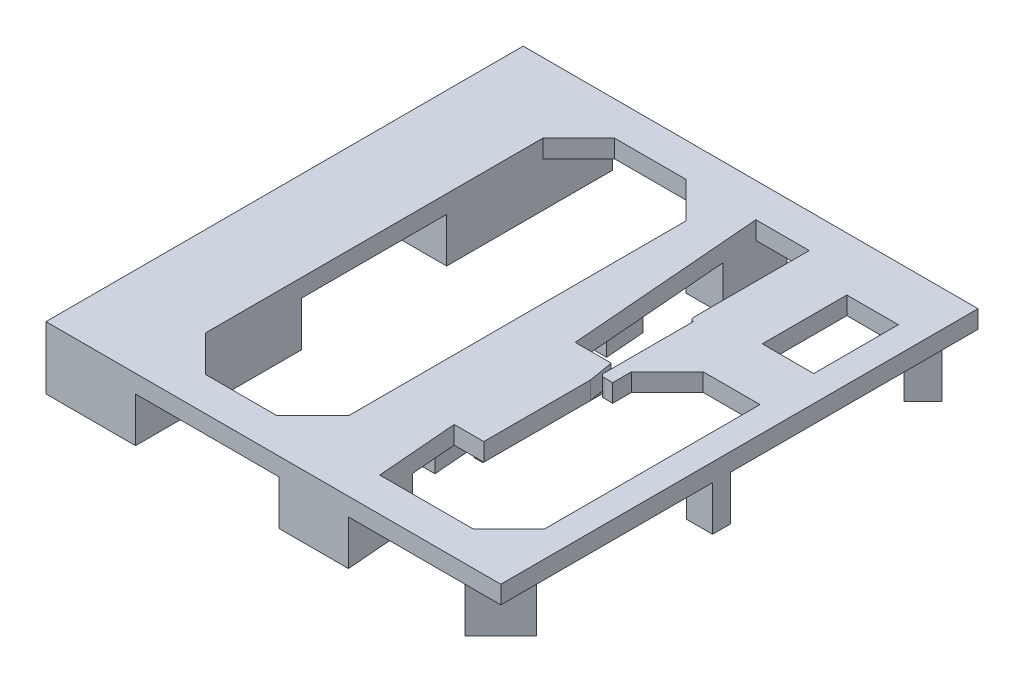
ISO-10303-21;
HEADER;
FILE_DESCRIPTION(('STEP AP214'),'2;1');
FILE_NAME('part.step','',(''),(''),'','','');
FILE_SCHEMA(('AUTOMOTIVE_DESIGN { 1 0 10303 214 1 1 1 1 }'));
ENDSEC;
DATA;
#1=APPLICATION_CONTEXT('core data for automotive mechanical design processes');
#2=APPLICATION_PROTOCOL_DEFINITION('international standard','automotive_design',2000,#1);
#3=PRODUCT_CONTEXT('',#1,'mechanical');
#4=PRODUCT('Part','Part','',(#3));
#5=PRODUCT_RELATED_PRODUCT_CATEGORY('part','',(#4));
#6=PRODUCT_DEFINITION_FORMATION('','',#4);
#7=PRODUCT_DEFINITION_CONTEXT('part definition',#1,'design');
#8=PRODUCT_DEFINITION('design','',#6,#7);
#9=PRODUCT_DEFINITION_SHAPE('','',#8);
#10=(LENGTH_UNIT() NAMED_UNIT(*) SI_UNIT(.MILLI.,.METRE.));
#11=(NAMED_UNIT(*) PLANE_ANGLE_UNIT() SI_UNIT($,.RADIAN.));
#12=(NAMED_UNIT(*) SI_UNIT($,.STERADIAN.) SOLID_ANGLE_UNIT());
#13=UNCERTAINTY_MEASURE_WITH_UNIT(LENGTH_MEASURE(1.E-05),#10,'distance_accuracy_value','');
#14=(GEOMETRIC_REPRESENTATION_CONTEXT(3) GLOBAL_UNCERTAINTY_ASSIGNED_CONTEXT((#13)) GLOBAL_UNIT_ASSIGNED_CONTEXT((#10,
#11,#12)) REPRESENTATION_CONTEXT('',''));
#15=CARTESIAN_POINT('',(0.,0.,0.));
#16=DIRECTION('',(0.,0.,1.));
#17=DIRECTION('',(1.,0.,0.));
#18=AXIS2_PLACEMENT_3D('',#15,#16,#17);
#19=CARTESIAN_POINT('',(0.,0.,0.));
#20=DIRECTION('',(0.,1.,0.));
#21=DIRECTION('',(0.,0.,1.));
#22=AXIS2_PLACEMENT_3D('',#19,#20,#21);
#23=PLANE('',#22);
#24=DIRECTION('',(-1.,0.,0.));
#25=VECTOR('',#24,1.);
#26=CARTESIAN_POINT('',(0.,0.,26.65));
#27=LINE('',#26,#25);
#28=CARTESIAN_POINT('',(52.9,0.,26.65));
#29=VERTEX_POINT('',#28);
#30=CARTESIAN_POINT('',(39.8829102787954,0.,26.65));
#31=VERTEX_POINT('',#30);
#32=EDGE_CURVE('E986',#29,#31,#27,.T.);
#33=ORIENTED_EDGE('',*,*,#32,.T.);
#34=DIRECTION('',(-0.0803714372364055,0.,-0.996764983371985));
#35=VECTOR('',#34,1.);
#36=CARTESIAN_POINT('',(39.253978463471,0.,18.85));
#37=LINE('',#36,#35);
#38=CARTESIAN_POINT('',(39.5765075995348,0.,22.85));
#39=VERTEX_POINT('',#38);
#40=EDGE_CURVE('E567',#31,#39,#37,.T.);
#41=ORIENTED_EDGE('',*,*,#40,.T.);
#42=DIRECTION('',(-1.,0.,0.));
#43=VECTOR('',#42,1.);
#44=CARTESIAN_POINT('',(0.,0.,22.85));
#45=LINE('',#44,#43);
#46=CARTESIAN_POINT('',(50.,0.,22.85));
#47=VERTEX_POINT('',#46);
#48=EDGE_CURVE('E1012',#47,#39,#45,.T.);
#49=ORIENTED_EDGE('',*,*,#48,.F.);
#50=DIRECTION('',(0.707106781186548,0.,-0.707106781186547));
#51=VECTOR('',#50,1.);
#52=CARTESIAN_POINT('',(36.425,0.,36.425));
#53=LINE('',#52,#51);
#54=CARTESIAN_POINT('',(54.,0.,18.85));
#55=VERTEX_POINT('',#54);
#56=EDGE_CURVE('E1009',#47,#55,#53,.T.);
#57=ORIENTED_EDGE('',*,*,#56,.T.);
#58=DIRECTION('',(0.,0.,-1.));
#59=VECTOR('',#58,1.);
#60=CARTESIAN_POINT('',(54.,0.,0.));
#61=LINE('',#60,#59);
#62=CARTESIAN_POINT('',(54.,0.,3.));
#63=VERTEX_POINT('',#62);
#64=EDGE_CURVE('E1006',#55,#63,#61,.T.);
#65=ORIENTED_EDGE('',*,*,#64,.T.);
#66=DIRECTION('',(1.,0.,0.));
#67=VECTOR('',#66,1.);
#68=CARTESIAN_POINT('',(54.,0.,3.));
#69=LINE('',#68,#67);
#70=CARTESIAN_POINT('',(56.9,0.,3.));
#71=VERTEX_POINT('',#70);
#72=EDGE_CURVE('E775',#63,#71,#69,.T.);
#73=ORIENTED_EDGE('',*,*,#72,.T.);
#74=DIRECTION('',(0.,0.,-1.));
#75=VECTOR('',#74,1.);
#76=CARTESIAN_POINT('',(56.9,0.,0.));
#77=LINE('',#76,#75);
#78=CARTESIAN_POINT('',(56.9,0.,22.65));
#79=VERTEX_POINT('',#78);
#80=EDGE_CURVE('E991',#79,#71,#77,.T.);
#81=ORIENTED_EDGE('',*,*,#80,.F.);
#82=DIRECTION('',(-0.707106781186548,0.,-0.707106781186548));
#83=VECTOR('',#82,1.);
#84=CARTESIAN_POINT('',(56.9,0.,22.65));
#85=LINE('',#84,#83);
#86=CARTESIAN_POINT('',(54.7786796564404,0.,20.5286796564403));
#87=VERTEX_POINT('',#86);
#88=EDGE_CURVE('E740',#79,#87,#85,.T.);
#89=ORIENTED_EDGE('',*,*,#88,.T.);
#90=DIRECTION('',(-0.707106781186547,0.,0.707106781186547));
#91=VECTOR('',#90,1.);
#92=CARTESIAN_POINT('',(54.7786796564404,0.,20.5286796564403));
#93=LINE('',#92,#91);
#94=CARTESIAN_POINT('',(50.7786796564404,0.,24.5286796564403));
#95=VERTEX_POINT('',#94);
#96=EDGE_CURVE('E765',#87,#95,#93,.T.);
#97=ORIENTED_EDGE('',*,*,#96,.T.);
#98=DIRECTION('',(0.707106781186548,0.,0.707106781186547));
#99=VECTOR('',#98,1.);
#100=CARTESIAN_POINT('',(50.7786796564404,0.,24.5286796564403));
#101=LINE('',#100,#99);
#102=EDGE_CURVE('E768',#95,#29,#101,.T.);
#103=ORIENTED_EDGE('',*,*,#102,.T.);
#104=EDGE_LOOP('',(#33,#41,#49,#57,#65,#73,#81,#89,#97,#103));
#105=FACE_BOUND('',#104,.T.);
#106=ADVANCED_FACE('F35',(#105),#23,.F.);
#107=DIRECTION('',(0.707106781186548,0.,-0.707106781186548));
#108=VECTOR('',#107,1.);
#109=CARTESIAN_POINT('',(25.475,0.,25.475));
#110=LINE('',#109,#108);
#111=CARTESIAN_POINT('',(28.1,0.,22.85));
#112=VERTEX_POINT('',#111);
#113=CARTESIAN_POINT('',(32.1,0.,18.85));
#114=VERTEX_POINT('',#113);
#115=EDGE_CURVE('E947',#112,#114,#110,.T.);
#116=ORIENTED_EDGE('',*,*,#115,.T.);
#117=DIRECTION('',(0.,0.,1.));
#118=VECTOR('',#117,1.);
#119=CARTESIAN_POINT('',(32.1,0.,18.85));
#120=LINE('',#119,#118);
#121=CARTESIAN_POINT('',(32.1,0.,26.65));
#122=VERTEX_POINT('',#121);
#123=EDGE_CURVE('E578',#114,#122,#120,.T.);
#124=ORIENTED_EDGE('',*,*,#123,.T.);
#125=CARTESIAN_POINT('',(16.1,0.,26.65));
#126=VERTEX_POINT('',#125);
#127=EDGE_CURVE('E981',#122,#126,#27,.T.);
#128=ORIENTED_EDGE('',*,*,#127,.T.);
#129=DIRECTION('',(0.,0.,-1.));
#130=VECTOR('',#129,1.);
#131=CARTESIAN_POINT('',(16.1,0.,8.1));
#132=LINE('',#131,#130);
#133=CARTESIAN_POINT('',(16.1,0.,18.85));
#134=VERTEX_POINT('',#133);
#135=EDGE_CURVE('E596',#126,#134,#132,.T.);
#136=ORIENTED_EDGE('',*,*,#135,.T.);
#137=DIRECTION('',(0.707106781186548,0.,0.707106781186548));
#138=VECTOR('',#137,1.);
#139=CARTESIAN_POINT('',(-1.37499999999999,0.,1.37499999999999));
#140=LINE('',#139,#138);
#141=CARTESIAN_POINT('',(20.1,0.,22.85));
#142=VERTEX_POINT('',#141);
#143=EDGE_CURVE('E954',#134,#142,#140,.T.);
#144=ORIENTED_EDGE('',*,*,#143,.T.);
#145=DIRECTION('',(1.,0.,0.));
#146=VECTOR('',#145,1.);
#147=CARTESIAN_POINT('',(0.,0.,22.85));
#148=LINE('',#147,#146);
#149=EDGE_CURVE('E951',#142,#112,#148,.T.);
#150=ORIENTED_EDGE('',*,*,#149,.T.);
#151=EDGE_LOOP('',(#116,#124,#128,#136,#144,#150));
#152=FACE_BOUND('',#151,.T.);
#153=ADVANCED_FACE('F1139',(#152),#23,.F.);
#154=DIRECTION('',(-1.,0.,0.));
#155=VECTOR('',#154,1.);
#156=CARTESIAN_POINT('',(40.7499999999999,0.,-0.500000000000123));
#157=LINE('',#156,#155);
#158=CARTESIAN_POINT('',(41.75,0.,-0.500000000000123));
#159=VERTEX_POINT('',#158);
#160=CARTESIAN_POINT('',(40.7499999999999,0.,-0.500000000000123));
#161=VERTEX_POINT('',#160);
#162=EDGE_CURVE('E526',#159,#161,#157,.T.);
#163=ORIENTED_EDGE('',*,*,#162,.T.);
#164=DIRECTION('',(0.,0.,1.));
#165=VECTOR('',#164,1.);
#166=CARTESIAN_POINT('',(40.7499999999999,0.,-0.500000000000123));
#167=LINE('',#166,#165);
#168=CARTESIAN_POINT('',(40.7499999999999,0.,13.4999999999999));
#169=VERTEX_POINT('',#168);
#170=EDGE_CURVE('E533',#161,#169,#167,.T.);
#171=ORIENTED_EDGE('',*,*,#170,.T.);
#172=DIRECTION('',(1.,0.,0.));
#173=VECTOR('',#172,1.);
#174=CARTESIAN_POINT('',(40.7499999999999,0.,13.4999999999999));
#175=LINE('',#174,#173);
#176=CARTESIAN_POINT('',(41.75,0.,13.4999999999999));
#177=VERTEX_POINT('',#176);
#178=EDGE_CURVE('E506',#169,#177,#175,.T.);
#179=ORIENTED_EDGE('',*,*,#178,.T.);
#180=DIRECTION('',(0.,0.,-1.));
#181=VECTOR('',#180,1.);
#182=CARTESIAN_POINT('',(41.75,0.,-0.500000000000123));
#183=LINE('',#182,#181);
#184=EDGE_CURVE('E52',#177,#159,#183,.T.);
#185=ORIENTED_EDGE('',*,*,#184,.T.);
#186=DIRECTION('',(0.166195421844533,0.,0.986092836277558));
#187=VECTOR('',#186,1.);
#188=CARTESIAN_POINT('',(40.6787687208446,0.,-6.85597225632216));
#189=LINE('',#188,#187);
#190=CARTESIAN_POINT('',(42.15,0.,1.8733333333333));
#191=VERTEX_POINT('',#190);
#192=EDGE_CURVE('E1021',#159,#191,#189,.T.);
#193=ORIENTED_EDGE('',*,*,#192,.T.);
#194=DIRECTION('',(0.,0.,1.));
#195=VECTOR('',#194,1.);
#196=CARTESIAN_POINT('',(42.15,0.,0.));
#197=LINE('',#196,#195);
#198=CARTESIAN_POINT('',(42.15,0.,13.8));
#199=VERTEX_POINT('',#198);
#200=EDGE_CURVE('E1018',#191,#199,#197,.T.);
#201=ORIENTED_EDGE('',*,*,#200,.T.);
#202=DIRECTION('',(-1.,0.,0.));
#203=VECTOR('',#202,1.);
#204=CARTESIAN_POINT('',(0.,0.,13.8));
#205=LINE('',#204,#203);
#206=CARTESIAN_POINT('',(38.8467854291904,0.,13.8));
#207=VERTEX_POINT('',#206);
#208=EDGE_CURVE('E1016',#199,#207,#205,.T.);
#209=ORIENTED_EDGE('',*,*,#208,.T.);
#210=DIRECTION('',(-0.0803714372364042,0.,-0.996764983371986));
#211=VECTOR('',#210,1.);
#212=CARTESIAN_POINT('',(37.4903141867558,0.,-3.02292966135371));
#213=LINE('',#212,#211);
#214=CARTESIAN_POINT('',(39.253978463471,0.,18.85));
#215=VERTEX_POINT('',#214);
#216=EDGE_CURVE('E60',#215,#207,#213,.T.);
#217=ORIENTED_EDGE('',*,*,#216,.F.);
#218=DIRECTION('',(-1.,0.,0.));
#219=VECTOR('',#218,1.);
#220=CARTESIAN_POINT('',(39.253978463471,0.,18.85));
#221=LINE('',#220,#219);
#222=EDGE_CURVE('E589',#215,#114,#221,.T.);
#223=ORIENTED_EDGE('',*,*,#222,.T.);
#224=DIRECTION('',(0.,0.,-1.));
#225=VECTOR('',#224,1.);
#226=CARTESIAN_POINT('',(32.1,0.,0.));
#227=LINE('',#226,#225);
#228=CARTESIAN_POINT('',(32.1,0.,12.65));
#229=VERTEX_POINT('',#228);
#230=EDGE_CURVE('E945',#114,#229,#227,.T.);
#231=ORIENTED_EDGE('',*,*,#230,.T.);
#232=DIRECTION('',(1.,0.,0.));
#233=VECTOR('',#232,1.);
#234=CARTESIAN_POINT('',(32.0999999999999,0.,12.65));
#235=LINE('',#234,#233);
#236=CARTESIAN_POINT('',(35.5485089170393,0.,12.65));
#237=VERTEX_POINT('',#236);
#238=EDGE_CURVE('E709',#229,#237,#235,.T.);
#239=ORIENTED_EDGE('',*,*,#238,.T.);
#240=DIRECTION('',(-0.080371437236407,0.,-0.996764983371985));
#241=VECTOR('',#240,1.);
#242=CARTESIAN_POINT('',(35.5485089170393,0.,12.65));
#243=LINE('',#242,#241);
#244=CARTESIAN_POINT('',(35.1896952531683,0.,8.2));
#245=VERTEX_POINT('',#244);
#246=EDGE_CURVE('E733',#237,#245,#243,.T.);
#247=ORIENTED_EDGE('',*,*,#246,.T.);
#248=DIRECTION('',(-1.,0.,0.));
#249=VECTOR('',#248,1.);
#250=CARTESIAN_POINT('',(32.1,0.,8.2));
#251=LINE('',#250,#249);
#252=CARTESIAN_POINT('',(32.1,0.,8.2));
#253=VERTEX_POINT('',#252);
#254=EDGE_CURVE('E722',#245,#253,#251,.T.);
#255=ORIENTED_EDGE('',*,*,#254,.T.);
#256=CARTESIAN_POINT('',(32.1,0.,-8.2));
#257=VERTEX_POINT('',#256);
#258=EDGE_CURVE('E948',#253,#257,#227,.T.);
#259=ORIENTED_EDGE('',*,*,#258,.T.);
#260=DIRECTION('',(1.,0.,0.));
#261=VECTOR('',#260,1.);
#262=CARTESIAN_POINT('',(32.1,0.,-8.2));
#263=LINE('',#262,#261);
#264=CARTESIAN_POINT('',(33.8673257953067,0.,-8.20000000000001));
#265=VERTEX_POINT('',#264);
#266=EDGE_CURVE('E678',#257,#265,#263,.T.);
#267=ORIENTED_EDGE('',*,*,#266,.T.);
#268=DIRECTION('',(-0.0803714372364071,0.,-0.996764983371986));
#269=VECTOR('',#268,1.);
#270=CARTESIAN_POINT('',(33.8673257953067,0.,-8.20000000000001));
#271=LINE('',#270,#269);
#272=CARTESIAN_POINT('',(33.5085121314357,0.,-12.65));
#273=VERTEX_POINT('',#272);
#274=EDGE_CURVE('E702',#265,#273,#271,.T.);
#275=ORIENTED_EDGE('',*,*,#274,.T.);
#276=DIRECTION('',(-1.,0.,0.));
#277=VECTOR('',#276,1.);
#278=CARTESIAN_POINT('',(33.5085121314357,0.,-12.65));
#279=LINE('',#278,#277);
#280=CARTESIAN_POINT('',(32.0999999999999,0.,-12.65));
#281=VERTEX_POINT('',#280);
#282=EDGE_CURVE('E691',#273,#281,#279,.T.);
#283=ORIENTED_EDGE('',*,*,#282,.T.);
#284=CARTESIAN_POINT('',(32.1,0.,-18.85));
#285=VERTEX_POINT('',#284);
#286=EDGE_CURVE('E944',#281,#285,#227,.T.);
#287=ORIENTED_EDGE('',*,*,#286,.T.);
#288=DIRECTION('',(1.,0.,0.));
#289=VECTOR('',#288,1.);
#290=CARTESIAN_POINT('',(32.0999999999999,0.,-18.85));
#291=LINE('',#290,#289);
#292=CARTESIAN_POINT('',(36.2141413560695,0.,-18.85));
#293=VERTEX_POINT('',#292);
#294=EDGE_CURVE('E671',#285,#293,#291,.T.);
#295=ORIENTED_EDGE('',*,*,#294,.T.);
#296=DIRECTION('',(0.080371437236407,0.,0.996764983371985));
#297=VECTOR('',#296,1.);
#298=CARTESIAN_POINT('',(37.4903141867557,0.,-3.02292966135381));
#299=LINE('',#298,#297);
#300=CARTESIAN_POINT('',(37.6614908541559,0.,-0.900000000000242));
#301=VERTEX_POINT('',#300);
#302=EDGE_CURVE('E1028',#293,#301,#299,.T.);
#303=ORIENTED_EDGE('',*,*,#302,.T.);
#304=DIRECTION('',(1.,0.,0.));
#305=VECTOR('',#304,1.);
#306=CARTESIAN_POINT('',(0.,0.,-0.900000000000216));
#307=LINE('',#306,#305);
#308=CARTESIAN_POINT('',(41.6825842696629,0.,-0.900000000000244));
#309=VERTEX_POINT('',#308);
#310=EDGE_CURVE('E1025',#301,#309,#307,.T.);
#311=ORIENTED_EDGE('',*,*,#310,.T.);
#312=EDGE_CURVE('E1022',#309,#159,#189,.T.);
#313=ORIENTED_EDGE('',*,*,#312,.T.);
#314=EDGE_LOOP('',(#163,#171,#179,#185,#193,#201,#209,#217,#223,#231,#239,#247,#255,#259,#267,
#275,#283,#287,#295,#303,#311,#313));
#315=FACE_BOUND('',#314,.T.);
#316=ADVANCED_FACE('F1175',(#315),#23,.F.);
#317=DIRECTION('',(0.,0.,1.));
#318=VECTOR('',#317,1.);
#319=CARTESIAN_POINT('',(16.1,0.,0.));
#320=LINE('',#319,#318);
#321=CARTESIAN_POINT('',(16.0999999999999,0.,-8.1));
#322=VERTEX_POINT('',#321);
#323=CARTESIAN_POINT('',(16.1,0.,8.1));
#324=VERTEX_POINT('',#323);
#325=EDGE_CURVE('E957',#322,#324,#320,.T.);
#326=ORIENTED_EDGE('',*,*,#325,.T.);
#327=DIRECTION('',(-1.,0.,0.));
#328=VECTOR('',#327,1.);
#329=CARTESIAN_POINT('',(16.1,0.,8.1));
#330=LINE('',#329,#328);
#331=CARTESIAN_POINT('',(6.10000000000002,0.,8.1));
#332=VERTEX_POINT('',#331);
#333=EDGE_CURVE('E608',#324,#332,#330,.T.);
#334=ORIENTED_EDGE('',*,*,#333,.T.);
#335=DIRECTION('',(0.,0.,1.));
#336=VECTOR('',#335,1.);
#337=CARTESIAN_POINT('',(6.10000000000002,0.,0.));
#338=LINE('',#337,#336);
#339=CARTESIAN_POINT('',(6.10000000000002,0.,-8.1));
#340=VERTEX_POINT('',#339);
#341=EDGE_CURVE('E977',#340,#332,#338,.T.);
#342=ORIENTED_EDGE('',*,*,#341,.F.);
#343=DIRECTION('',(1.,0.,0.));
#344=VECTOR('',#343,1.);
#345=CARTESIAN_POINT('',(16.0999999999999,0.,-8.1));
#346=LINE('',#345,#344);
#347=EDGE_CURVE('E624',#340,#322,#346,.T.);
#348=ORIENTED_EDGE('',*,*,#347,.T.);
#349=EDGE_LOOP('',(#326,#334,#342,#348));
#350=FACE_BOUND('',#349,.T.);
#351=ADVANCED_FACE('F1156',(#350),#23,.F.);
#352=CARTESIAN_POINT('',(42.65,0.,0.5));
#353=DIRECTION('',(0.,1.,0.));
#354=DIRECTION('',(0.,0.,1.));
#355=AXIS2_PLACEMENT_3D('',#352,#353,#354);
#356=CIRCLE('',#355,0.399999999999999);
#357=CARTESIAN_POINT('',(42.25,0.,0.500000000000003));
#358=VERTEX_POINT('',#357);
#359=CARTESIAN_POINT('',(42.65,0.,0.9));
#360=VERTEX_POINT('',#359);
#361=EDGE_CURVE('E990',#358,#360,#356,.T.);
#362=ORIENTED_EDGE('',*,*,#361,.F.);
#363=DIRECTION('',(1.,0.,0.));
#364=VECTOR('',#363,1.);
#365=CARTESIAN_POINT('',(43.25,0.,0.499999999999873));
#366=LINE('',#365,#364);
#367=CARTESIAN_POINT('',(43.25,0.,0.499999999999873));
#368=VERTEX_POINT('',#367);
#369=EDGE_CURVE('E546',#358,#368,#366,.T.);
#370=ORIENTED_EDGE('',*,*,#369,.T.);
#371=DIRECTION('',(0.,0.,-1.));
#372=VECTOR('',#371,1.);
#373=CARTESIAN_POINT('',(43.25,0.,-13.5000000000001));
#374=LINE('',#373,#372);
#375=CARTESIAN_POINT('',(43.25,0.,-13.5000000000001));
#376=VERTEX_POINT('',#375);
#377=EDGE_CURVE('E538',#368,#376,#374,.T.);
#378=ORIENTED_EDGE('',*,*,#377,.T.);
#379=DIRECTION('',(-1.,0.,0.));
#380=VECTOR('',#379,1.);
#381=CARTESIAN_POINT('',(43.25,0.,-13.5000000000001));
#382=LINE('',#381,#380);
#383=CARTESIAN_POINT('',(42.25,0.,-13.5000000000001));
#384=VERTEX_POINT('',#383);
#385=EDGE_CURVE('E558',#376,#384,#382,.T.);
#386=ORIENTED_EDGE('',*,*,#385,.T.);
#387=DIRECTION('',(0.,0.,1.));
#388=VECTOR('',#387,1.);
#389=CARTESIAN_POINT('',(42.25,0.,-13.5000000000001));
#390=LINE('',#389,#388);
#391=CARTESIAN_POINT('',(42.25,0.,-9.5));
#392=VERTEX_POINT('',#391);
#393=EDGE_CURVE('E561',#384,#392,#390,.T.);
#394=ORIENTED_EDGE('',*,*,#393,.T.);
#395=CARTESIAN_POINT('',(42.25,0.,-9.89999999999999));
#396=DIRECTION('',(0.,1.,0.));
#397=DIRECTION('',(0.,0.,1.));
#398=AXIS2_PLACEMENT_3D('',#395,#396,#397);
#399=CIRCLE('',#398,0.399999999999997);
#400=CARTESIAN_POINT('',(41.85,0.,-9.9));
#401=VERTEX_POINT('',#400);
#402=EDGE_CURVE('E848',#401,#392,#399,.T.);
#403=ORIENTED_EDGE('',*,*,#402,.F.);
#404=DIRECTION('',(0.,0.,-1.));
#405=VECTOR('',#404,1.);
#406=CARTESIAN_POINT('',(41.85,0.,0.));
#407=LINE('',#406,#405);
#408=CARTESIAN_POINT('',(41.85,0.,-22.85));
#409=VERTEX_POINT('',#408);
#410=EDGE_CURVE('E1033',#401,#409,#407,.T.);
#411=ORIENTED_EDGE('',*,*,#410,.T.);
#412=DIRECTION('',(-1.,0.,0.));
#413=VECTOR('',#412,1.);
#414=CARTESIAN_POINT('',(0.,0.,-22.85));
#415=LINE('',#414,#413);
#416=CARTESIAN_POINT('',(35.8916122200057,0.,-22.85));
#417=VERTEX_POINT('',#416);
#418=EDGE_CURVE('E1030',#409,#417,#415,.T.);
#419=ORIENTED_EDGE('',*,*,#418,.T.);
#420=DIRECTION('',(-0.0803714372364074,0.,-0.996764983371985));
#421=VECTOR('',#420,1.);
#422=CARTESIAN_POINT('',(36.2141413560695,0.,-18.85));
#423=LINE('',#422,#421);
#424=CARTESIAN_POINT('',(35.5852095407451,0.,-26.65));
#425=VERTEX_POINT('',#424);
#426=EDGE_CURVE('E660',#417,#425,#423,.T.);
#427=ORIENTED_EDGE('',*,*,#426,.T.);
#428=DIRECTION('',(1.,0.,0.));
#429=VECTOR('',#428,1.);
#430=CARTESIAN_POINT('',(0.,0.,-26.65));
#431=LINE('',#430,#429);
#432=CARTESIAN_POINT('',(52.9,0.,-26.65));
#433=VERTEX_POINT('',#432);
#434=EDGE_CURVE('E978',#425,#433,#431,.T.);
#435=ORIENTED_EDGE('',*,*,#434,.T.);
#436=DIRECTION('',(-0.707106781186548,0.,0.707106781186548));
#437=VECTOR('',#436,1.);
#438=CARTESIAN_POINT('',(50.7786796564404,0.,-24.5286796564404));
#439=LINE('',#438,#437);
#440=CARTESIAN_POINT('',(50.7786796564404,0.,-24.5286796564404));
#441=VERTEX_POINT('',#440);
#442=EDGE_CURVE('E829',#433,#441,#439,.T.);
#443=ORIENTED_EDGE('',*,*,#442,.T.);
#444=DIRECTION('',(0.707106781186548,0.,0.707106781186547));
#445=VECTOR('',#444,1.);
#446=CARTESIAN_POINT('',(54.7786796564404,0.,-20.5286796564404));
#447=LINE('',#446,#445);
#448=CARTESIAN_POINT('',(54.7786796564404,0.,-20.5286796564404));
#449=VERTEX_POINT('',#448);
#450=EDGE_CURVE('E814',#441,#449,#447,.T.);
#451=ORIENTED_EDGE('',*,*,#450,.T.);
#452=DIRECTION('',(0.707106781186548,0.,-0.707106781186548));
#453=VECTOR('',#452,1.);
#454=CARTESIAN_POINT('',(54.7786796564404,0.,-20.5286796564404));
#455=LINE('',#454,#453);
#456=CARTESIAN_POINT('',(56.9,0.,-22.65));
#457=VERTEX_POINT('',#456);
#458=EDGE_CURVE('E802',#449,#457,#455,.T.);
#459=ORIENTED_EDGE('',*,*,#458,.T.);
#460=CARTESIAN_POINT('',(56.9,0.,1.));
#461=VERTEX_POINT('',#460);
#462=EDGE_CURVE('E1313',#461,#457,#77,.T.);
#463=ORIENTED_EDGE('',*,*,#462,.F.);
#464=DIRECTION('',(-1.,0.,0.));
#465=VECTOR('',#464,1.);
#466=CARTESIAN_POINT('',(56.9,0.,1.));
#467=LINE('',#466,#465);
#468=CARTESIAN_POINT('',(54.,0.,1.));
#469=VERTEX_POINT('',#468);
#470=EDGE_CURVE('E786',#461,#469,#467,.T.);
#471=ORIENTED_EDGE('',*,*,#470,.T.);
#472=CARTESIAN_POINT('',(54.,0.,-5.2));
#473=VERTEX_POINT('',#472);
#474=EDGE_CURVE('E1005',#469,#473,#61,.T.);
#475=ORIENTED_EDGE('',*,*,#474,.T.);
#476=DIRECTION('',(-1.,0.,0.));
#477=VECTOR('',#476,1.);
#478=CARTESIAN_POINT('',(0.,0.,-5.2));
#479=LINE('',#478,#477);
#480=CARTESIAN_POINT('',(47.65,0.,-5.2));
#481=VERTEX_POINT('',#480);
#482=EDGE_CURVE('E1002',#473,#481,#479,.T.);
#483=ORIENTED_EDGE('',*,*,#482,.T.);
#484=DIRECTION('',(-0.707106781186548,0.,0.707106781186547));
#485=VECTOR('',#484,1.);
#486=CARTESIAN_POINT('',(21.225,0.,21.225));
#487=LINE('',#486,#485);
#488=CARTESIAN_POINT('',(43.65,0.,-1.2));
#489=VERTEX_POINT('',#488);
#490=EDGE_CURVE('E999',#481,#489,#487,.T.);
#491=ORIENTED_EDGE('',*,*,#490,.T.);
#492=DIRECTION('',(0.,0.,1.));
#493=VECTOR('',#492,1.);
#494=CARTESIAN_POINT('',(43.65,0.,0.));
#495=LINE('',#494,#493);
#496=CARTESIAN_POINT('',(43.65,0.,0.9));
#497=VERTEX_POINT('',#496);
#498=EDGE_CURVE('E996',#489,#497,#495,.T.);
#499=ORIENTED_EDGE('',*,*,#498,.T.);
#500=DIRECTION('',(1.,0.,0.));
#501=VECTOR('',#500,1.);
#502=CARTESIAN_POINT('',(0.,0.,0.900000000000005));
#503=LINE('',#502,#501);
#504=EDGE_CURVE('E993',#360,#497,#503,.T.);
#505=ORIENTED_EDGE('',*,*,#504,.F.);
#506=EDGE_LOOP('',(#362,#370,#378,#386,#394,#403,#411,#419,#427,#435,#443,#451,#459,#463,#471,
#475,#483,#491,#499,#505));
#507=FACE_BOUND('',#506,.T.);
#508=DIRECTION('',(0.,0.,-1.));
#509=VECTOR('',#508,1.);
#510=CARTESIAN_POINT('',(54.,0.,0.));
#511=LINE('',#510,#509);
#512=CARTESIAN_POINT('',(54.,0.,-11.2));
#513=VERTEX_POINT('',#512);
#514=CARTESIAN_POINT('',(54.,0.,-20.65));
#515=VERTEX_POINT('',#514);
#516=EDGE_CURVE('E962',#513,#515,#511,.T.);
#517=ORIENTED_EDGE('',*,*,#516,.T.);
#518=DIRECTION('',(-1.,0.,0.));
#519=VECTOR('',#518,1.);
#520=CARTESIAN_POINT('',(0.,0.,-20.65));
#521=LINE('',#520,#519);
#522=CARTESIAN_POINT('',(48.25,0.,-20.65));
#523=VERTEX_POINT('',#522);
#524=EDGE_CURVE('E971',#515,#523,#521,.T.);
#525=ORIENTED_EDGE('',*,*,#524,.T.);
#526=DIRECTION('',(0.,0.,1.));
#527=VECTOR('',#526,1.);
#528=CARTESIAN_POINT('',(48.25,0.,0.));
#529=LINE('',#528,#527);
#530=CARTESIAN_POINT('',(48.25,0.,-11.2));
#531=VERTEX_POINT('',#530);
#532=EDGE_CURVE('E968',#523,#531,#529,.T.);
#533=ORIENTED_EDGE('',*,*,#532,.T.);
#534=DIRECTION('',(-1.,0.,0.));
#535=VECTOR('',#534,1.);
#536=CARTESIAN_POINT('',(0.,0.,-11.2));
#537=LINE('',#536,#535);
#538=EDGE_CURVE('E965',#513,#531,#537,.T.);
#539=ORIENTED_EDGE('',*,*,#538,.F.);
#540=EDGE_LOOP('',(#517,#525,#533,#539));
#541=FACE_BOUND('',#540,.T.);
#542=ADVANCED_FACE('F1239',(#507,#541),#23,.F.);
#543=DIRECTION('',(-0.707106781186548,0.,0.707106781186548));
#544=VECTOR('',#543,1.);
#545=CARTESIAN_POINT('',(-1.375,0.,-1.375));
#546=LINE('',#545,#544);
#547=CARTESIAN_POINT('',(20.1,0.,-22.85));
#548=VERTEX_POINT('',#547);
#549=CARTESIAN_POINT('',(16.1,0.,-18.85));
#550=VERTEX_POINT('',#549);
#551=EDGE_CURVE('E959',#548,#550,#546,.T.);
#552=ORIENTED_EDGE('',*,*,#551,.T.);
#553=DIRECTION('',(0.,0.,-1.));
#554=VECTOR('',#553,1.);
#555=CARTESIAN_POINT('',(16.0999999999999,0.,-8.1));
#556=LINE('',#555,#554);
#557=CARTESIAN_POINT('',(16.0999999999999,0.,-26.65));
#558=VERTEX_POINT('',#557);
#559=EDGE_CURVE('E634',#550,#558,#556,.T.);
#560=ORIENTED_EDGE('',*,*,#559,.T.);
#561=CARTESIAN_POINT('',(32.0999999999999,0.,-26.65));
#562=VERTEX_POINT('',#561);
#563=EDGE_CURVE('E975',#558,#562,#431,.T.);
#564=ORIENTED_EDGE('',*,*,#563,.T.);
#565=DIRECTION('',(0.,0.,1.));
#566=VECTOR('',#565,1.);
#567=CARTESIAN_POINT('',(32.0999999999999,0.,-26.65));
#568=LINE('',#567,#566);
#569=EDGE_CURVE('E650',#562,#285,#568,.T.);
#570=ORIENTED_EDGE('',*,*,#569,.T.);
#571=DIRECTION('',(0.707106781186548,0.,0.707106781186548));
#572=VECTOR('',#571,1.);
#573=CARTESIAN_POINT('',(25.475,0.,-25.475));
#574=LINE('',#573,#572);
#575=CARTESIAN_POINT('',(28.1,0.,-22.85));
#576=VERTEX_POINT('',#575);
#577=EDGE_CURVE('E941',#576,#285,#574,.T.);
#578=ORIENTED_EDGE('',*,*,#577,.F.);
#579=DIRECTION('',(1.,0.,0.));
#580=VECTOR('',#579,1.);
#581=CARTESIAN_POINT('',(0.,0.,-22.85));
#582=LINE('',#581,#580);
#583=EDGE_CURVE('E836',#548,#576,#582,.T.);
#584=ORIENTED_EDGE('',*,*,#583,.F.);
#585=EDGE_LOOP('',(#552,#560,#564,#570,#578,#584));
#586=FACE_BOUND('',#585,.T.);
#587=ADVANCED_FACE('F1120',(#586),#23,.F.);
#588=CARTESIAN_POINT('',(56.9,0.,26.65));
#589=VERTEX_POINT('',#588);
#590=EDGE_CURVE('E982',#589,#29,#27,.T.);
#591=ORIENTED_EDGE('',*,*,#590,.T.);
#592=DIRECTION('',(0.707106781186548,0.,-0.707106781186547));
#593=VECTOR('',#592,1.);
#594=CARTESIAN_POINT('',(56.9,0.,22.65));
#595=LINE('',#594,#593);
#596=EDGE_CURVE('E753',#29,#79,#595,.T.);
#597=ORIENTED_EDGE('',*,*,#596,.T.);
#598=EDGE_CURVE('E987',#589,#79,#77,.T.);
#599=ORIENTED_EDGE('',*,*,#598,.F.);
#600=EDGE_LOOP('',(#591,#597,#599));
#601=FACE_BOUND('',#600,.T.);
#602=ADVANCED_FACE('F1219',(#601),#23,.F.);
#603=CARTESIAN_POINT('',(42.25,2.,0.));
#604=DIRECTION('',(1.,0.,0.));
#605=DIRECTION('',(0.,0.,-1.));
#606=AXIS2_PLACEMENT_3D('',#603,#604,#605);
#607=PLANE('',#606);
#608=DIRECTION('',(0.,-1.,0.));
#609=VECTOR('',#608,1.);
#610=CARTESIAN_POINT('',(42.25,2.,-9.5));
#611=LINE('',#610,#609);
#612=CARTESIAN_POINT('',(42.25,2.,-9.5));
#613=VERTEX_POINT('',#612);
#614=EDGE_CURVE('E1038',#613,#392,#611,.T.);
#615=ORIENTED_EDGE('',*,*,#614,.T.);
#616=ORIENTED_EDGE('',*,*,#393,.F.);
#617=DIRECTION('',(0.,1.,0.));
#618=VECTOR('',#617,1.);
#619=CARTESIAN_POINT('',(42.25,-0.4,-13.5000000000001));
#620=LINE('',#619,#618);
#621=CARTESIAN_POINT('',(42.25,-0.4,-13.5000000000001));
#622=VERTEX_POINT('',#621);
#623=EDGE_CURVE('E571',#622,#384,#620,.T.);
#624=ORIENTED_EDGE('',*,*,#623,.F.);
#625=DIRECTION('',(0.,0.,1.));
#626=VECTOR('',#625,1.);
#627=CARTESIAN_POINT('',(42.25,-0.4,-13.5000000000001));
#628=LINE('',#627,#626);
#629=CARTESIAN_POINT('',(42.25,-0.4,0.499999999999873));
#630=VERTEX_POINT('',#629);
#631=EDGE_CURVE('E549',#622,#630,#628,.T.);
#632=ORIENTED_EDGE('',*,*,#631,.T.);
#633=DIRECTION('',(0.,1.,0.));
#634=VECTOR('',#633,1.);
#635=CARTESIAN_POINT('',(42.25,-0.4,0.499999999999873));
#636=LINE('',#635,#634);
#637=EDGE_CURVE('E568',#630,#358,#636,.T.);
#638=ORIENTED_EDGE('',*,*,#637,.T.);
#639=DIRECTION('',(0.,-1.,0.));
#640=VECTOR('',#639,1.);
#641=CARTESIAN_POINT('',(42.25,2.,0.500000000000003));
#642=LINE('',#641,#640);
#643=CARTESIAN_POINT('',(42.25,2.,0.500000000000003));
#644=VERTEX_POINT('',#643);
#645=EDGE_CURVE('E11',#644,#358,#642,.T.);
#646=ORIENTED_EDGE('',*,*,#645,.F.);
#647=DIRECTION('',(0.,0.,1.));
#648=VECTOR('',#647,1.);
#649=CARTESIAN_POINT('',(42.25,2.,0.));
#650=LINE('',#649,#648);
#651=EDGE_CURVE('E889',#613,#644,#650,.T.);
#652=ORIENTED_EDGE('',*,*,#651,.F.);
#653=EDGE_LOOP('',(#615,#616,#624,#632,#638,#646,#652));
#654=FACE_BOUND('',#653,.T.);
#655=ADVANCED_FACE('F1230',(#654),#607,.F.);
#656=CARTESIAN_POINT('',(42.65,2.,0.5));
#657=DIRECTION('',(0.,-1.,0.));
#658=DIRECTION('',(0.,0.,-1.));
#659=AXIS2_PLACEMENT_3D('',#656,#657,#658);
#660=CYLINDRICAL_SURFACE('',#659,0.399999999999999);
#661=ORIENTED_EDGE('',*,*,#361,.T.);
#662=DIRECTION('',(0.,-1.,0.));
#663=VECTOR('',#662,1.);
#664=CARTESIAN_POINT('',(42.65,2.,0.9));
#665=LINE('',#664,#663);
#666=CARTESIAN_POINT('',(42.65,2.,0.9));
#667=VERTEX_POINT('',#666);
#668=EDGE_CURVE('E44',#667,#360,#665,.T.);
#669=ORIENTED_EDGE('',*,*,#668,.F.);
#670=CARTESIAN_POINT('',(42.65,2.,0.5));
#671=DIRECTION('',(0.,1.,0.));
#672=DIRECTION('',(0.,0.,1.));
#673=AXIS2_PLACEMENT_3D('',#670,#671,#672);
#674=CIRCLE('',#673,0.399999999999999);
#675=EDGE_CURVE('E892',#644,#667,#674,.T.);
#676=ORIENTED_EDGE('',*,*,#675,.F.);
#677=ORIENTED_EDGE('',*,*,#645,.T.);
#678=EDGE_LOOP('',(#661,#669,#676,#677));
#679=FACE_BOUND('',#678,.T.);
#680=ADVANCED_FACE('F1236',(#679),#660,.T.);
#681=CARTESIAN_POINT('',(0.,2.,0.900000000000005));
#682=DIRECTION('',(0.,0.,-1.));
#683=DIRECTION('',(-1.,0.,0.));
#684=AXIS2_PLACEMENT_3D('',#681,#682,#683);
#685=PLANE('',#684);
#686=ORIENTED_EDGE('',*,*,#504,.T.);
#687=DIRECTION('',(0.,-1.,0.));
#688=VECTOR('',#687,1.);
#689=CARTESIAN_POINT('',(43.65,2.,0.9));
#690=LINE('',#689,#688);
#691=CARTESIAN_POINT('',(43.65,2.,0.9));
#692=VERTEX_POINT('',#691);
#693=EDGE_CURVE('E1075',#692,#497,#690,.T.);
#694=ORIENTED_EDGE('',*,*,#693,.F.);
#695=DIRECTION('',(1.,0.,0.));
#696=VECTOR('',#695,1.);
#697=CARTESIAN_POINT('',(0.,2.,0.900000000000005));
#698=LINE('',#697,#696);
#699=EDGE_CURVE('E894',#667,#692,#698,.T.);
#700=ORIENTED_EDGE('',*,*,#699,.F.);
#701=ORIENTED_EDGE('',*,*,#668,.T.);
#702=EDGE_LOOP('',(#686,#694,#700,#701));
#703=FACE_BOUND('',#702,.T.);
#704=ADVANCED_FACE('F1345',(#703),#685,.F.);
#705=CARTESIAN_POINT('',(43.65,2.,0.));
#706=DIRECTION('',(1.,0.,0.));
#707=DIRECTION('',(0.,0.,-1.));
#708=AXIS2_PLACEMENT_3D('',#705,#706,#707);
#709=PLANE('',#708);
#710=ORIENTED_EDGE('',*,*,#498,.F.);
#711=DIRECTION('',(0.,-1.,0.));
#712=VECTOR('',#711,1.);
#713=CARTESIAN_POINT('',(43.65,2.,-1.2));
#714=LINE('',#713,#712);
#715=CARTESIAN_POINT('',(43.65,2.,-1.2));
#716=VERTEX_POINT('',#715);
#717=EDGE_CURVE('E1073',#716,#489,#714,.T.);
#718=ORIENTED_EDGE('',*,*,#717,.F.);
#719=DIRECTION('',(0.,0.,1.));
#720=VECTOR('',#719,1.);
#721=CARTESIAN_POINT('',(43.65,2.,0.));
#722=LINE('',#721,#720);
#723=EDGE_CURVE('E896',#716,#692,#722,.T.);
#724=ORIENTED_EDGE('',*,*,#723,.T.);
#725=ORIENTED_EDGE('',*,*,#693,.T.);
#726=EDGE_LOOP('',(#710,#718,#724,#725));
#727=FACE_BOUND('',#726,.T.);
#728=ADVANCED_FACE('F1341',(#727),#709,.T.);
#729=CARTESIAN_POINT('',(21.225,2.,21.225));
#730=DIRECTION('',(0.707106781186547,0.,0.707106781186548));
#731=DIRECTION('',(0.707106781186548,0.,-0.707106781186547));
#732=AXIS2_PLACEMENT_3D('',#729,#730,#731);
#733=PLANE('',#732);
#734=ORIENTED_EDGE('',*,*,#490,.F.);
#735=DIRECTION('',(0.,-1.,0.));
#736=VECTOR('',#735,1.);
#737=CARTESIAN_POINT('',(47.65,2.,-5.2));
#738=LINE('',#737,#736);
#739=CARTESIAN_POINT('',(47.65,2.,-5.2));
#740=VERTEX_POINT('',#739);
#741=EDGE_CURVE('E1071',#740,#481,#738,.T.);
#742=ORIENTED_EDGE('',*,*,#741,.F.);
#743=DIRECTION('',(-0.707106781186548,0.,0.707106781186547));
#744=VECTOR('',#743,1.);
#745=CARTESIAN_POINT('',(21.225,2.,21.225));
#746=LINE('',#745,#744);
#747=EDGE_CURVE('E899',#740,#716,#746,.T.);
#748=ORIENTED_EDGE('',*,*,#747,.T.);
#749=ORIENTED_EDGE('',*,*,#717,.T.);
#750=EDGE_LOOP('',(#734,#742,#748,#749));
#751=FACE_BOUND('',#750,.T.);
#752=ADVANCED_FACE('F1337',(#751),#733,.T.);
#753=CARTESIAN_POINT('',(0.,2.,-5.2));
#754=DIRECTION('',(0.,0.,1.));
#755=DIRECTION('',(1.,0.,0.));
#756=AXIS2_PLACEMENT_3D('',#753,#754,#755);
#757=PLANE('',#756);
#758=ORIENTED_EDGE('',*,*,#482,.F.);
#759=DIRECTION('',(0.,-1.,0.));
#760=VECTOR('',#759,1.);
#761=CARTESIAN_POINT('',(54.,2.,-5.2));
#762=LINE('',#761,#760);
#763=CARTESIAN_POINT('',(54.,2.,-5.2));
#764=VERTEX_POINT('',#763);
#765=EDGE_CURVE('E1068',#764,#473,#762,.T.);
#766=ORIENTED_EDGE('',*,*,#765,.F.);
#767=DIRECTION('',(-1.,0.,0.));
#768=VECTOR('',#767,1.);
#769=CARTESIAN_POINT('',(0.,2.,-5.2));
#770=LINE('',#769,#768);
#771=EDGE_CURVE('E902',#764,#740,#770,.T.);
#772=ORIENTED_EDGE('',*,*,#771,.T.);
#773=ORIENTED_EDGE('',*,*,#741,.T.);
#774=EDGE_LOOP('',(#758,#766,#772,#773));
#775=FACE_BOUND('',#774,.T.);
#776=ADVANCED_FACE('F1332',(#775),#757,.T.);
#777=CARTESIAN_POINT('',(54.,2.,0.));
#778=DIRECTION('',(-1.,0.,0.));
#779=DIRECTION('',(0.,0.,1.));
#780=AXIS2_PLACEMENT_3D('',#777,#778,#779);
#781=PLANE('',#780);
#782=ORIENTED_EDGE('',*,*,#64,.F.);
#783=DIRECTION('',(0.,-1.,0.));
#784=VECTOR('',#783,1.);
#785=CARTESIAN_POINT('',(54.,2.,18.85));
#786=LINE('',#785,#784);
#787=CARTESIAN_POINT('',(54.,2.,18.85));
#788=VERTEX_POINT('',#787);
#789=EDGE_CURVE('E1066',#788,#55,#786,.T.);
#790=ORIENTED_EDGE('',*,*,#789,.F.);
#791=DIRECTION('',(0.,0.,-1.));
#792=VECTOR('',#791,1.);
#793=CARTESIAN_POINT('',(54.,2.,0.));
#794=LINE('',#793,#792);
#795=EDGE_CURVE('E905',#788,#764,#794,.T.);
#796=ORIENTED_EDGE('',*,*,#795,.T.);
#797=ORIENTED_EDGE('',*,*,#765,.T.);
#798=ORIENTED_EDGE('',*,*,#474,.F.);
#799=DIRECTION('',(0.,1.,0.));
#800=VECTOR('',#799,1.);
#801=CARTESIAN_POINT('',(54.,-5.,1.));
#802=LINE('',#801,#800);
#803=CARTESIAN_POINT('',(54.,-5.,1.));
#804=VERTEX_POINT('',#803);
#805=EDGE_CURVE('E803',#804,#469,#802,.T.);
#806=ORIENTED_EDGE('',*,*,#805,.F.);
#807=DIRECTION('',(0.,0.,1.));
#808=VECTOR('',#807,1.);
#809=CARTESIAN_POINT('',(54.,-5.,1.));
#810=LINE('',#809,#808);
#811=CARTESIAN_POINT('',(54.,-5.,3.));
#812=VERTEX_POINT('',#811);
#813=EDGE_CURVE('E792',#804,#812,#810,.T.);
#814=ORIENTED_EDGE('',*,*,#813,.T.);
#815=DIRECTION('',(0.,1.,0.));
#816=VECTOR('',#815,1.);
#817=CARTESIAN_POINT('',(54.,-5.,3.));
#818=LINE('',#817,#816);
#819=EDGE_CURVE('E800',#812,#63,#818,.T.);
#820=ORIENTED_EDGE('',*,*,#819,.T.);
#821=EDGE_LOOP('',(#782,#790,#796,#797,#798,#806,#814,#820));
#822=FACE_BOUND('',#821,.T.);
#823=ADVANCED_FACE('F1324',(#822),#781,.T.);
#824=CARTESIAN_POINT('',(36.425,2.,36.425));
#825=DIRECTION('',(-0.707106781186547,0.,-0.707106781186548));
#826=DIRECTION('',(-0.707106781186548,0.,0.707106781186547));
#827=AXIS2_PLACEMENT_3D('',#824,#825,#826);
#828=PLANE('',#827);
#829=ORIENTED_EDGE('',*,*,#56,.F.);
#830=DIRECTION('',(0.,-1.,0.));
#831=VECTOR('',#830,1.);
#832=CARTESIAN_POINT('',(50.,2.,22.85));
#833=LINE('',#832,#831);
#834=CARTESIAN_POINT('',(50.,2.,22.85));
#835=VERTEX_POINT('',#834);
#836=EDGE_CURVE('E1064',#835,#47,#833,.T.);
#837=ORIENTED_EDGE('',*,*,#836,.F.);
#838=DIRECTION('',(0.707106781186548,0.,-0.707106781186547));
#839=VECTOR('',#838,1.);
#840=CARTESIAN_POINT('',(36.425,2.,36.425));
#841=LINE('',#840,#839);
#842=EDGE_CURVE('E908',#835,#788,#841,.T.);
#843=ORIENTED_EDGE('',*,*,#842,.T.);
#844=ORIENTED_EDGE('',*,*,#789,.T.);
#845=EDGE_LOOP('',(#829,#837,#843,#844));
#846=FACE_BOUND('',#845,.T.);
#847=ADVANCED_FACE('F1498',(#846),#828,.T.);
#848=CARTESIAN_POINT('',(0.,2.,22.85));
#849=DIRECTION('',(0.,0.,1.));
#850=DIRECTION('',(1.,0.,0.));
#851=AXIS2_PLACEMENT_3D('',#848,#849,#850);
#852=PLANE('',#851);
#853=ORIENTED_EDGE('',*,*,#48,.T.);
#854=DIRECTION('',(0.,-1.,0.));
#855=VECTOR('',#854,1.);
#856=CARTESIAN_POINT('',(39.5765075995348,2.,22.85));
#857=LINE('',#856,#855);
#858=CARTESIAN_POINT('',(39.5765075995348,2.,22.85));
#859=VERTEX_POINT('',#858);
#860=EDGE_CURVE('E1061',#859,#39,#857,.T.);
#861=ORIENTED_EDGE('',*,*,#860,.F.);
#862=DIRECTION('',(-1.,0.,0.));
#863=VECTOR('',#862,1.);
#864=CARTESIAN_POINT('',(0.,2.,22.85));
#865=LINE('',#864,#863);
#866=EDGE_CURVE('E911',#835,#859,#865,.T.);
#867=ORIENTED_EDGE('',*,*,#866,.F.);
#868=ORIENTED_EDGE('',*,*,#836,.T.);
#869=EDGE_LOOP('',(#853,#861,#867,#868));
#870=FACE_BOUND('',#869,.T.);
#871=ADVANCED_FACE('F1495',(#870),#852,.F.);
#872=CARTESIAN_POINT('',(37.4903141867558,2.,-3.02292966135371));
#873=DIRECTION('',(-0.996764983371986,0.,0.0803714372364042));
#874=DIRECTION('',(0.0803714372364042,0.,0.996764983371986));
#875=AXIS2_PLACEMENT_3D('',#872,#873,#874);
#876=PLANE('',#875);
#877=ORIENTED_EDGE('',*,*,#860,.T.);
#878=ORIENTED_EDGE('',*,*,#40,.F.);
#879=DIRECTION('',(0.,1.,0.));
#880=VECTOR('',#879,1.);
#881=CARTESIAN_POINT('',(39.8829102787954,-5.,26.65));
#882=LINE('',#881,#880);
#883=CARTESIAN_POINT('',(39.8829102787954,-5.,26.65));
#884=VERTEX_POINT('',#883);
#885=EDGE_CURVE('E593',#884,#31,#882,.T.);
#886=ORIENTED_EDGE('',*,*,#885,.F.);
#887=DIRECTION('',(-0.0803714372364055,0.,-0.996764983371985));
#888=VECTOR('',#887,1.);
#889=CARTESIAN_POINT('',(39.253978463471,-5.,18.85));
#890=LINE('',#889,#888);
#891=CARTESIAN_POINT('',(39.253978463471,-5.,18.85));
#892=VERTEX_POINT('',#891);
#893=EDGE_CURVE('E574',#884,#892,#890,.T.);
#894=ORIENTED_EDGE('',*,*,#893,.T.);
#895=DIRECTION('',(0.,1.,0.));
#896=VECTOR('',#895,1.);
#897=CARTESIAN_POINT('',(39.253978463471,-5.,18.85));
#898=LINE('',#897,#896);
#899=EDGE_CURVE('E587',#892,#215,#898,.T.);
#900=ORIENTED_EDGE('',*,*,#899,.T.);
#901=ORIENTED_EDGE('',*,*,#216,.T.);
#902=DIRECTION('',(0.,-1.,0.));
#903=VECTOR('',#902,1.);
#904=CARTESIAN_POINT('',(38.8467854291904,2.,13.8));
#905=LINE('',#904,#903);
#906=CARTESIAN_POINT('',(38.8467854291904,2.,13.8));
#907=VERTEX_POINT('',#906);
#908=EDGE_CURVE('E1058',#907,#207,#905,.T.);
#909=ORIENTED_EDGE('',*,*,#908,.F.);
#910=DIRECTION('',(-0.0803714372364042,0.,-0.996764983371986));
#911=VECTOR('',#910,1.);
#912=CARTESIAN_POINT('',(37.4903141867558,2.,-3.02292966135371));
#913=LINE('',#912,#911);
#914=EDGE_CURVE('E913',#859,#907,#913,.T.);
#915=ORIENTED_EDGE('',*,*,#914,.F.);
#916=EDGE_LOOP('',(#877,#878,#886,#894,#900,#901,#909,#915));
#917=FACE_BOUND('',#916,.T.);
#918=ADVANCED_FACE('F1409',(#917),#876,.F.);
#919=CARTESIAN_POINT('',(0.,2.,13.8));
#920=DIRECTION('',(0.,0.,1.));
#921=DIRECTION('',(1.,0.,0.));
#922=AXIS2_PLACEMENT_3D('',#919,#920,#921);
#923=PLANE('',#922);
#924=ORIENTED_EDGE('',*,*,#208,.F.);
#925=DIRECTION('',(0.,-1.,0.));
#926=VECTOR('',#925,1.);
#927=CARTESIAN_POINT('',(42.15,2.,13.8));
#928=LINE('',#927,#926);
#929=CARTESIAN_POINT('',(42.15,2.,13.8));
#930=VERTEX_POINT('',#929);
#931=EDGE_CURVE('E1056',#930,#199,#928,.T.);
#932=ORIENTED_EDGE('',*,*,#931,.F.);
#933=DIRECTION('',(-1.,0.,0.));
#934=VECTOR('',#933,1.);
#935=CARTESIAN_POINT('',(0.,2.,13.8));
#936=LINE('',#935,#934);
#937=EDGE_CURVE('E915',#930,#907,#936,.T.);
#938=ORIENTED_EDGE('',*,*,#937,.T.);
#939=ORIENTED_EDGE('',*,*,#908,.T.);
#940=EDGE_LOOP('',(#924,#932,#938,#939));
#941=FACE_BOUND('',#940,.T.);
#942=ADVANCED_FACE('F1405',(#941),#923,.T.);
#943=CARTESIAN_POINT('',(42.15,2.,0.));
#944=DIRECTION('',(1.,0.,0.));
#945=DIRECTION('',(0.,0.,-1.));
#946=AXIS2_PLACEMENT_3D('',#943,#944,#945);
#947=PLANE('',#946);
#948=ORIENTED_EDGE('',*,*,#200,.F.);
#949=DIRECTION('',(0.,-1.,0.));
#950=VECTOR('',#949,1.);
#951=CARTESIAN_POINT('',(42.15,2.,1.8733333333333));
#952=LINE('',#951,#950);
#953=CARTESIAN_POINT('',(42.15,2.,1.8733333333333));
#954=VERTEX_POINT('',#953);
#955=EDGE_CURVE('E1053',#954,#191,#952,.T.);
#956=ORIENTED_EDGE('',*,*,#955,.F.);
#957=DIRECTION('',(0.,0.,1.));
#958=VECTOR('',#957,1.);
#959=CARTESIAN_POINT('',(42.15,2.,0.));
#960=LINE('',#959,#958);
#961=EDGE_CURVE('E918',#954,#930,#960,.T.);
#962=ORIENTED_EDGE('',*,*,#961,.T.);
#963=ORIENTED_EDGE('',*,*,#931,.T.);
#964=EDGE_LOOP('',(#948,#956,#962,#963));
#965=FACE_BOUND('',#964,.T.);
#966=ADVANCED_FACE('F1401',(#965),#947,.T.);
#967=CARTESIAN_POINT('',(40.6787687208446,2.,-6.85597225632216));
#968=DIRECTION('',(0.986092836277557,0.,-0.166195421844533));
#969=DIRECTION('',(-0.166195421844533,0.,-0.986092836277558));
#970=AXIS2_PLACEMENT_3D('',#967,#968,#969);
#971=PLANE('',#970);
#972=ORIENTED_EDGE('',*,*,#312,.F.);
#973=DIRECTION('',(0.,-1.,0.));
#974=VECTOR('',#973,1.);
#975=CARTESIAN_POINT('',(41.6825842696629,2.,-0.900000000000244));
#976=LINE('',#975,#974);
#977=CARTESIAN_POINT('',(41.6825842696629,2.,-0.900000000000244));
#978=VERTEX_POINT('',#977);
#979=EDGE_CURVE('E1051',#978,#309,#976,.T.);
#980=ORIENTED_EDGE('',*,*,#979,.F.);
#981=DIRECTION('',(0.166195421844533,0.,0.986092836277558));
#982=VECTOR('',#981,1.);
#983=CARTESIAN_POINT('',(40.6787687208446,2.,-6.85597225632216));
#984=LINE('',#983,#982);
#985=EDGE_CURVE('E921',#978,#954,#984,.T.);
#986=ORIENTED_EDGE('',*,*,#985,.T.);
#987=ORIENTED_EDGE('',*,*,#955,.T.);
#988=ORIENTED_EDGE('',*,*,#192,.F.);
#989=EDGE_LOOP('',(#972,#980,#986,#987,#988));
#990=FACE_BOUND('',#989,.T.);
#991=ADVANCED_FACE('F1397',(#990),#971,.T.);
#992=CARTESIAN_POINT('',(0.,2.,-0.900000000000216));
#993=DIRECTION('',(0.,0.,-1.));
#994=DIRECTION('',(-1.,0.,0.));
#995=AXIS2_PLACEMENT_3D('',#992,#993,#994);
#996=PLANE('',#995);
#997=ORIENTED_EDGE('',*,*,#310,.F.);
#998=DIRECTION('',(0.,-1.,0.));
#999=VECTOR('',#998,1.);
#1000=CARTESIAN_POINT('',(37.6614908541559,2.,-0.900000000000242));
#1001=LINE('',#1000,#999);
#1002=CARTESIAN_POINT('',(37.6614908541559,2.,-0.900000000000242));
#1003=VERTEX_POINT('',#1002);
#1004=EDGE_CURVE('E1048',#1003,#301,#1001,.T.);
#1005=ORIENTED_EDGE('',*,*,#1004,.F.);
#1006=DIRECTION('',(1.,0.,0.));
#1007=VECTOR('',#1006,1.);
#1008=CARTESIAN_POINT('',(0.,2.,-0.900000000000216));
#1009=LINE('',#1008,#1007);
#1010=EDGE_CURVE('E924',#1003,#978,#1009,.T.);
#1011=ORIENTED_EDGE('',*,*,#1010,.T.);
#1012=ORIENTED_EDGE('',*,*,#979,.T.);
#1013=EDGE_LOOP('',(#997,#1005,#1011,#1012));
#1014=FACE_BOUND('',#1013,.T.);
#1015=ADVANCED_FACE('F1392',(#1014),#996,.T.);
#1016=CARTESIAN_POINT('',(37.4903141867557,2.,-3.02292966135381));
#1017=DIRECTION('',(0.996764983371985,0.,-0.080371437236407));
#1018=DIRECTION('',(-0.080371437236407,0.,-0.996764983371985));
#1019=AXIS2_PLACEMENT_3D('',#1016,#1017,#1018);
#1020=PLANE('',#1019);
#1021=ORIENTED_EDGE('',*,*,#302,.F.);
#1022=DIRECTION('',(0.,1.,0.));
#1023=VECTOR('',#1022,1.);
#1024=CARTESIAN_POINT('',(36.2141413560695,-5.,-18.85));
#1025=LINE('',#1024,#1023);
#1026=CARTESIAN_POINT('',(36.2141413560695,-5.,-18.85));
#1027=VERTEX_POINT('',#1026);
#1028=EDGE_CURVE('E682',#1027,#293,#1025,.T.);
#1029=ORIENTED_EDGE('',*,*,#1028,.F.);
#1030=DIRECTION('',(-0.0803714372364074,0.,-0.996764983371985));
#1031=VECTOR('',#1030,1.);
#1032=CARTESIAN_POINT('',(36.2141413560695,-5.,-18.85));
#1033=LINE('',#1032,#1031);
#1034=CARTESIAN_POINT('',(35.5852095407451,-5.,-26.65));
#1035=VERTEX_POINT('',#1034);
#1036=EDGE_CURVE('E663',#1027,#1035,#1033,.T.);
#1037=ORIENTED_EDGE('',*,*,#1036,.T.);
#1038=DIRECTION('',(0.,1.,0.));
#1039=VECTOR('',#1038,1.);
#1040=CARTESIAN_POINT('',(35.5852095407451,-5.,-26.65));
#1041=LINE('',#1040,#1039);
#1042=EDGE_CURVE('E679',#1035,#425,#1041,.T.);
#1043=ORIENTED_EDGE('',*,*,#1042,.T.);
#1044=ORIENTED_EDGE('',*,*,#426,.F.);
#1045=DIRECTION('',(0.,-1.,0.));
#1046=VECTOR('',#1045,1.);
#1047=CARTESIAN_POINT('',(35.8916122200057,2.,-22.85));
#1048=LINE('',#1047,#1046);
#1049=CARTESIAN_POINT('',(35.8916122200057,2.,-22.85));
#1050=VERTEX_POINT('',#1049);
#1051=EDGE_CURVE('E1046',#1050,#417,#1048,.T.);
#1052=ORIENTED_EDGE('',*,*,#1051,.F.);
#1053=DIRECTION('',(0.080371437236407,0.,0.996764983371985));
#1054=VECTOR('',#1053,1.);
#1055=CARTESIAN_POINT('',(37.4903141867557,2.,-3.02292966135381));
#1056=LINE('',#1055,#1054);
#1057=EDGE_CURVE('E927',#1050,#1003,#1056,.T.);
#1058=ORIENTED_EDGE('',*,*,#1057,.T.);
#1059=ORIENTED_EDGE('',*,*,#1004,.T.);
#1060=EDGE_LOOP('',(#1021,#1029,#1037,#1043,#1044,#1052,#1058,#1059));
#1061=FACE_BOUND('',#1060,.T.);
#1062=ADVANCED_FACE('F1377',(#1061),#1020,.T.);
#1063=CARTESIAN_POINT('',(0.,2.,-22.85));
#1064=DIRECTION('',(0.,0.,1.));
#1065=DIRECTION('',(1.,0.,0.));
#1066=AXIS2_PLACEMENT_3D('',#1063,#1064,#1065);
#1067=PLANE('',#1066);
#1068=ORIENTED_EDGE('',*,*,#418,.F.);
#1069=DIRECTION('',(0.,-1.,0.));
#1070=VECTOR('',#1069,1.);
#1071=CARTESIAN_POINT('',(41.85,2.,-22.85));
#1072=LINE('',#1071,#1070);
#1073=CARTESIAN_POINT('',(41.85,2.,-22.85));
#1074=VERTEX_POINT('',#1073);
#1075=EDGE_CURVE('E1044',#1074,#409,#1072,.T.);
#1076=ORIENTED_EDGE('',*,*,#1075,.F.);
#1077=DIRECTION('',(-1.,0.,0.));
#1078=VECTOR('',#1077,1.);
#1079=CARTESIAN_POINT('',(0.,2.,-22.85));
#1080=LINE('',#1079,#1078);
#1081=EDGE_CURVE('E930',#1074,#1050,#1080,.T.);
#1082=ORIENTED_EDGE('',*,*,#1081,.T.);
#1083=ORIENTED_EDGE('',*,*,#1051,.T.);
#1084=EDGE_LOOP('',(#1068,#1076,#1082,#1083));
#1085=FACE_BOUND('',#1084,.T.);
#1086=ADVANCED_FACE('F1374',(#1085),#1067,.T.);
#1087=CARTESIAN_POINT('',(41.85,2.,0.));
#1088=DIRECTION('',(-1.,0.,0.));
#1089=DIRECTION('',(0.,0.,1.));
#1090=AXIS2_PLACEMENT_3D('',#1087,#1088,#1089);
#1091=PLANE('',#1090);
#1092=ORIENTED_EDGE('',*,*,#410,.F.);
#1093=DIRECTION('',(0.,-1.,0.));
#1094=VECTOR('',#1093,1.);
#1095=CARTESIAN_POINT('',(41.85,2.,-9.9));
#1096=LINE('',#1095,#1094);
#1097=CARTESIAN_POINT('',(41.85,2.,-9.9));
#1098=VERTEX_POINT('',#1097);
#1099=EDGE_CURVE('E1041',#1098,#401,#1096,.T.);
#1100=ORIENTED_EDGE('',*,*,#1099,.F.);
#1101=DIRECTION('',(0.,0.,-1.));
#1102=VECTOR('',#1101,1.);
#1103=CARTESIAN_POINT('',(41.85,2.,0.));
#1104=LINE('',#1103,#1102);
#1105=EDGE_CURVE('E933',#1098,#1074,#1104,.T.);
#1106=ORIENTED_EDGE('',*,*,#1105,.T.);
#1107=ORIENTED_EDGE('',*,*,#1075,.T.);
#1108=EDGE_LOOP('',(#1092,#1100,#1106,#1107));
#1109=FACE_BOUND('',#1108,.T.);
#1110=ADVANCED_FACE('F1370',(#1109),#1091,.T.);
#1111=CARTESIAN_POINT('',(0.,2.,-26.65));
#1112=DIRECTION('',(0.,0.,-1.));
#1113=DIRECTION('',(-1.,0.,0.));
#1114=AXIS2_PLACEMENT_3D('',#1111,#1112,#1113);
#1115=PLANE('',#1114);
#1116=ORIENTED_EDGE('',*,*,#563,.F.);
#1117=DIRECTION('',(0.,1.,0.));
#1118=VECTOR('',#1117,1.);
#1119=CARTESIAN_POINT('',(16.0999999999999,-5.,-26.65));
#1120=LINE('',#1119,#1118);
#1121=CARTESIAN_POINT('',(16.0999999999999,-5.,-26.65));
#1122=VERTEX_POINT('',#1121);
#1123=EDGE_CURVE('E651',#1122,#558,#1120,.T.);
#1124=ORIENTED_EDGE('',*,*,#1123,.F.);
#1125=DIRECTION('',(-1.,0.,0.));
#1126=VECTOR('',#1125,1.);
#1127=CARTESIAN_POINT('',(16.0999999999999,-5.,-26.65));
#1128=LINE('',#1127,#1126);
#1129=CARTESIAN_POINT('',(6.09999999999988,-5.,-26.65));
#1130=VERTEX_POINT('',#1129);
#1131=EDGE_CURVE('E637',#1122,#1130,#1128,.T.);
#1132=ORIENTED_EDGE('',*,*,#1131,.T.);
#1133=DIRECTION('',(0.,-1.,0.));
#1134=VECTOR('',#1133,1.);
#1135=CARTESIAN_POINT('',(6.10000000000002,2.,-26.65));
#1136=LINE('',#1135,#1134);
#1137=CARTESIAN_POINT('',(6.10000000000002,2.,-26.65));
#1138=VERTEX_POINT('',#1137);
#1139=EDGE_CURVE('E1042',#1138,#1130,#1136,.T.);
#1140=ORIENTED_EDGE('',*,*,#1139,.F.);
#1141=DIRECTION('',(1.,0.,0.));
#1142=VECTOR('',#1141,1.);
#1143=CARTESIAN_POINT('',(0.,2.,-26.65));
#1144=LINE('',#1143,#1142);
#1145=CARTESIAN_POINT('',(56.9,2.,-26.65));
#1146=VERTEX_POINT('',#1145);
#1147=EDGE_CURVE('E879',#1138,#1146,#1144,.T.);
#1148=ORIENTED_EDGE('',*,*,#1147,.T.);
#1149=DIRECTION('',(0.,-1.,0.));
#1150=VECTOR('',#1149,1.);
#1151=CARTESIAN_POINT('',(56.9,2.,-26.65));
#1152=LINE('',#1151,#1150);
#1153=CARTESIAN_POINT('',(56.9,0.,-26.65));
#1154=VERTEX_POINT('',#1153);
#1155=EDGE_CURVE('E1079',#1146,#1154,#1152,.T.);
#1156=ORIENTED_EDGE('',*,*,#1155,.T.);
#1157=EDGE_CURVE('E974',#433,#1154,#431,.T.);
#1158=ORIENTED_EDGE('',*,*,#1157,.F.);
#1159=ORIENTED_EDGE('',*,*,#434,.F.);
#1160=ORIENTED_EDGE('',*,*,#1042,.F.);
#1161=DIRECTION('',(-1.,0.,0.));
#1162=VECTOR('',#1161,1.);
#1163=CARTESIAN_POINT('',(32.0999999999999,-5.,-26.65));
#1164=LINE('',#1163,#1162);
#1165=CARTESIAN_POINT('',(32.0999999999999,-5.,-26.65));
#1166=VERTEX_POINT('',#1165);
#1167=EDGE_CURVE('E666',#1035,#1166,#1164,.T.);
#1168=ORIENTED_EDGE('',*,*,#1167,.T.);
#1169=DIRECTION('',(0.,1.,0.));
#1170=VECTOR('',#1169,1.);
#1171=CARTESIAN_POINT('',(32.0999999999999,-5.,-26.65));
#1172=LINE('',#1171,#1170);
#1173=EDGE_CURVE('E675',#1166,#562,#1172,.T.);
#1174=ORIENTED_EDGE('',*,*,#1173,.T.);
#1175=EDGE_LOOP('',(#1116,#1124,#1132,#1140,#1148,#1156,#1158,#1159,#1160,#1168,#1174));
#1176=FACE_BOUND('',#1175,.T.);
#1177=ADVANCED_FACE('F1171',(#1176),#1115,.T.);
#1178=CARTESIAN_POINT('',(6.10000000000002,2.,0.));
#1179=DIRECTION('',(1.,0.,0.));
#1180=DIRECTION('',(0.,0.,-1.));
#1181=AXIS2_PLACEMENT_3D('',#1178,#1179,#1180);
#1182=PLANE('',#1181);
#1183=ORIENTED_EDGE('',*,*,#1139,.T.);
#1184=DIRECTION('',(0.,0.,1.));
#1185=VECTOR('',#1184,1.);
#1186=CARTESIAN_POINT('',(6.09999999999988,-5.,-8.1));
#1187=LINE('',#1186,#1185);
#1188=CARTESIAN_POINT('',(6.09999999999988,-5.,-8.1));
#1189=VERTEX_POINT('',#1188);
#1190=EDGE_CURVE('E640',#1130,#1189,#1187,.T.);
#1191=ORIENTED_EDGE('',*,*,#1190,.T.);
#1192=DIRECTION('',(0.,1.,0.));
#1193=VECTOR('',#1192,1.);
#1194=CARTESIAN_POINT('',(6.09999999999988,-5.,-8.1));
#1195=LINE('',#1194,#1193);
#1196=EDGE_CURVE('E647',#1189,#340,#1195,.T.);
#1197=ORIENTED_EDGE('',*,*,#1196,.T.);
#1198=ORIENTED_EDGE('',*,*,#341,.T.);
#1199=DIRECTION('',(0.,1.,0.));
#1200=VECTOR('',#1199,1.);
#1201=CARTESIAN_POINT('',(6.10000000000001,-5.,8.1));
#1202=LINE('',#1201,#1200);
#1203=CARTESIAN_POINT('',(6.10000000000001,-5.,8.1));
#1204=VERTEX_POINT('',#1203);
#1205=EDGE_CURVE('E625',#1204,#332,#1202,.T.);
#1206=ORIENTED_EDGE('',*,*,#1205,.F.);
#1207=DIRECTION('',(0.,0.,1.));
#1208=VECTOR('',#1207,1.);
#1209=CARTESIAN_POINT('',(6.10000000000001,-5.,8.1));
#1210=LINE('',#1209,#1208);
#1211=CARTESIAN_POINT('',(6.10000000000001,-5.,26.65));
#1212=VERTEX_POINT('',#1211);
#1213=EDGE_CURVE('E611',#1204,#1212,#1210,.T.);
#1214=ORIENTED_EDGE('',*,*,#1213,.T.);
#1215=DIRECTION('',(0.,-1.,0.));
#1216=VECTOR('',#1215,1.);
#1217=CARTESIAN_POINT('',(6.10000000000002,2.,26.65));
#1218=LINE('',#1217,#1216);
#1219=CARTESIAN_POINT('',(6.10000000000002,2.,26.65));
#1220=VERTEX_POINT('',#1219);
#1221=EDGE_CURVE('E1085',#1220,#1212,#1218,.T.);
#1222=ORIENTED_EDGE('',*,*,#1221,.F.);
#1223=DIRECTION('',(0.,0.,1.));
#1224=VECTOR('',#1223,1.);
#1225=CARTESIAN_POINT('',(6.10000000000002,2.,0.));
#1226=LINE('',#1225,#1224);
#1227=EDGE_CURVE('E882',#1138,#1220,#1226,.T.);
#1228=ORIENTED_EDGE('',*,*,#1227,.F.);
#1229=EDGE_LOOP('',(#1183,#1191,#1197,#1198,#1206,#1214,#1222,#1228));
#1230=FACE_BOUND('',#1229,.T.);
#1231=ADVANCED_FACE('F1165',(#1230),#1182,.F.);
#1232=CARTESIAN_POINT('',(0.,2.,26.65));
#1233=DIRECTION('',(0.,0.,1.));
#1234=DIRECTION('',(1.,0.,0.));
#1235=AXIS2_PLACEMENT_3D('',#1232,#1233,#1234);
#1236=PLANE('',#1235);
#1237=ORIENTED_EDGE('',*,*,#590,.F.);
#1238=DIRECTION('',(0.,-1.,0.));
#1239=VECTOR('',#1238,1.);
#1240=CARTESIAN_POINT('',(56.9,2.,26.65));
#1241=LINE('',#1240,#1239);
#1242=CARTESIAN_POINT('',(56.9,2.,26.65));
#1243=VERTEX_POINT('',#1242);
#1244=EDGE_CURVE('E1082',#1243,#589,#1241,.T.);
#1245=ORIENTED_EDGE('',*,*,#1244,.F.);
#1246=DIRECTION('',(-1.,0.,0.));
#1247=VECTOR('',#1246,1.);
#1248=CARTESIAN_POINT('',(0.,2.,26.65));
#1249=LINE('',#1248,#1247);
#1250=EDGE_CURVE('E884',#1243,#1220,#1249,.T.);
#1251=ORIENTED_EDGE('',*,*,#1250,.T.);
#1252=ORIENTED_EDGE('',*,*,#1221,.T.);
#1253=DIRECTION('',(1.,0.,0.));
#1254=VECTOR('',#1253,1.);
#1255=CARTESIAN_POINT('',(16.1,-5.,26.65));
#1256=LINE('',#1255,#1254);
#1257=CARTESIAN_POINT('',(16.1,-5.,26.65));
#1258=VERTEX_POINT('',#1257);
#1259=EDGE_CURVE('E614',#1212,#1258,#1256,.T.);
#1260=ORIENTED_EDGE('',*,*,#1259,.T.);
#1261=DIRECTION('',(0.,1.,0.));
#1262=VECTOR('',#1261,1.);
#1263=CARTESIAN_POINT('',(16.1,-5.,26.65));
#1264=LINE('',#1263,#1262);
#1265=EDGE_CURVE('E621',#1258,#126,#1264,.T.);
#1266=ORIENTED_EDGE('',*,*,#1265,.T.);
#1267=ORIENTED_EDGE('',*,*,#127,.F.);
#1268=DIRECTION('',(0.,1.,0.));
#1269=VECTOR('',#1268,1.);
#1270=CARTESIAN_POINT('',(32.1,-5.,26.65));
#1271=LINE('',#1270,#1269);
#1272=CARTESIAN_POINT('',(32.1,-5.,26.65));
#1273=VERTEX_POINT('',#1272);
#1274=EDGE_CURVE('E597',#1273,#122,#1271,.T.);
#1275=ORIENTED_EDGE('',*,*,#1274,.F.);
#1276=DIRECTION('',(1.,0.,0.));
#1277=VECTOR('',#1276,1.);
#1278=CARTESIAN_POINT('',(32.1,-5.,26.65));
#1279=LINE('',#1278,#1277);
#1280=EDGE_CURVE('E584',#1273,#884,#1279,.T.);
#1281=ORIENTED_EDGE('',*,*,#1280,.T.);
#1282=ORIENTED_EDGE('',*,*,#885,.T.);
#1283=ORIENTED_EDGE('',*,*,#32,.F.);
#1284=EDGE_LOOP('',(#1237,#1245,#1251,#1252,#1260,#1266,#1267,#1275,#1281,#1282,#1283));
#1285=FACE_BOUND('',#1284,.T.);
#1286=ADVANCED_FACE('F1143',(#1285),#1236,.T.);
#1287=CARTESIAN_POINT('',(54.,2.,0.));
#1288=DIRECTION('',(-1.,0.,0.));
#1289=DIRECTION('',(0.,0.,1.));
#1290=AXIS2_PLACEMENT_3D('',#1287,#1288,#1289);
#1291=PLANE('',#1290);
#1292=ORIENTED_EDGE('',*,*,#516,.F.);
#1293=DIRECTION('',(0.,-1.,0.));
#1294=VECTOR('',#1293,1.);
#1295=CARTESIAN_POINT('',(54.,2.,-11.2));
#1296=LINE('',#1295,#1294);
#1297=CARTESIAN_POINT('',(54.,2.,-11.2));
#1298=VERTEX_POINT('',#1297);
#1299=EDGE_CURVE('E1083',#1298,#513,#1296,.T.);
#1300=ORIENTED_EDGE('',*,*,#1299,.F.);
#1301=DIRECTION('',(0.,0.,-1.));
#1302=VECTOR('',#1301,1.);
#1303=CARTESIAN_POINT('',(54.,2.,0.));
#1304=LINE('',#1303,#1302);
#1305=CARTESIAN_POINT('',(54.,2.,-20.65));
#1306=VERTEX_POINT('',#1305);
#1307=EDGE_CURVE('E868',#1298,#1306,#1304,.T.);
#1308=ORIENTED_EDGE('',*,*,#1307,.T.);
#1309=DIRECTION('',(0.,-1.,0.));
#1310=VECTOR('',#1309,1.);
#1311=CARTESIAN_POINT('',(54.,2.,-20.65));
#1312=LINE('',#1311,#1310);
#1313=EDGE_CURVE('E1088',#1306,#515,#1312,.T.);
#1314=ORIENTED_EDGE('',*,*,#1313,.T.);
#1315=EDGE_LOOP('',(#1292,#1300,#1308,#1314));
#1316=FACE_BOUND('',#1315,.T.);
#1317=ADVANCED_FACE('F1447',(#1316),#1291,.T.);
#1318=CARTESIAN_POINT('',(0.,2.,-11.2));
#1319=DIRECTION('',(0.,0.,1.));
#1320=DIRECTION('',(1.,0.,0.));
#1321=AXIS2_PLACEMENT_3D('',#1318,#1319,#1320);
#1322=PLANE('',#1321);
#1323=ORIENTED_EDGE('',*,*,#538,.T.);
#1324=DIRECTION('',(0.,-1.,0.));
#1325=VECTOR('',#1324,1.);
#1326=CARTESIAN_POINT('',(48.25,2.,-11.2));
#1327=LINE('',#1326,#1325);
#1328=CARTESIAN_POINT('',(48.25,2.,-11.2));
#1329=VERTEX_POINT('',#1328);
#1330=EDGE_CURVE('E1092',#1329,#531,#1327,.T.);
#1331=ORIENTED_EDGE('',*,*,#1330,.F.);
#1332=DIRECTION('',(-1.,0.,0.));
#1333=VECTOR('',#1332,1.);
#1334=CARTESIAN_POINT('',(0.,2.,-11.2));
#1335=LINE('',#1334,#1333);
#1336=EDGE_CURVE('E871',#1298,#1329,#1335,.T.);
#1337=ORIENTED_EDGE('',*,*,#1336,.F.);
#1338=ORIENTED_EDGE('',*,*,#1299,.T.);
#1339=EDGE_LOOP('',(#1323,#1331,#1337,#1338));
#1340=FACE_BOUND('',#1339,.T.);
#1341=ADVANCED_FACE('F1441',(#1340),#1322,.F.);
#1342=CARTESIAN_POINT('',(48.25,2.,0.));
#1343=DIRECTION('',(1.,0.,0.));
#1344=DIRECTION('',(0.,0.,-1.));
#1345=AXIS2_PLACEMENT_3D('',#1342,#1343,#1344);
#1346=PLANE('',#1345);
#1347=ORIENTED_EDGE('',*,*,#532,.F.);
#1348=DIRECTION('',(0.,-1.,0.));
#1349=VECTOR('',#1348,1.);
#1350=CARTESIAN_POINT('',(48.25,2.,-20.65));
#1351=LINE('',#1350,#1349);
#1352=CARTESIAN_POINT('',(48.25,2.,-20.65));
#1353=VERTEX_POINT('',#1352);
#1354=EDGE_CURVE('E1090',#1353,#523,#1351,.T.);
#1355=ORIENTED_EDGE('',*,*,#1354,.F.);
#1356=DIRECTION('',(0.,0.,1.));
#1357=VECTOR('',#1356,1.);
#1358=CARTESIAN_POINT('',(48.25,2.,0.));
#1359=LINE('',#1358,#1357);
#1360=EDGE_CURVE('E873',#1353,#1329,#1359,.T.);
#1361=ORIENTED_EDGE('',*,*,#1360,.T.);
#1362=ORIENTED_EDGE('',*,*,#1330,.T.);
#1363=EDGE_LOOP('',(#1347,#1355,#1361,#1362));
#1364=FACE_BOUND('',#1363,.T.);
#1365=ADVANCED_FACE('F1437',(#1364),#1346,.T.);
#1366=CARTESIAN_POINT('',(0.,2.,-22.85));
#1367=DIRECTION('',(0.,0.,-1.));
#1368=DIRECTION('',(-1.,0.,0.));
#1369=AXIS2_PLACEMENT_3D('',#1366,#1367,#1368);
#1370=PLANE('',#1369);
#1371=ORIENTED_EDGE('',*,*,#583,.T.);
#1372=DIRECTION('',(0.,-1.,0.));
#1373=VECTOR('',#1372,1.);
#1374=CARTESIAN_POINT('',(28.1,2.,-22.85));
#1375=LINE('',#1374,#1373);
#1376=CARTESIAN_POINT('',(28.1,2.,-22.85));
#1377=VERTEX_POINT('',#1376);
#1378=EDGE_CURVE('E39',#1377,#576,#1375,.T.);
#1379=ORIENTED_EDGE('',*,*,#1378,.F.);
#1380=DIRECTION('',(1.,0.,0.));
#1381=VECTOR('',#1380,1.);
#1382=CARTESIAN_POINT('',(0.,2.,-22.85));
#1383=LINE('',#1382,#1381);
#1384=CARTESIAN_POINT('',(20.1,2.,-22.85));
#1385=VERTEX_POINT('',#1384);
#1386=EDGE_CURVE('E844',#1385,#1377,#1383,.T.);
#1387=ORIENTED_EDGE('',*,*,#1386,.F.);
#1388=DIRECTION('',(0.,-1.,0.));
#1389=VECTOR('',#1388,1.);
#1390=CARTESIAN_POINT('',(20.1,2.,-22.85));
#1391=LINE('',#1390,#1389);
#1392=EDGE_CURVE('E938',#1385,#548,#1391,.T.);
#1393=ORIENTED_EDGE('',*,*,#1392,.T.);
#1394=EDGE_LOOP('',(#1371,#1379,#1387,#1393));
#1395=FACE_BOUND('',#1394,.T.);
#1396=ADVANCED_FACE('F37',(#1395),#1370,.F.);
#1397=CARTESIAN_POINT('',(25.475,2.,-25.475));
#1398=DIRECTION('',(0.707106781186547,0.,-0.707106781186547));
#1399=DIRECTION('',(-0.707106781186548,0.,-0.707106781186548));
#1400=AXIS2_PLACEMENT_3D('',#1397,#1398,#1399);
#1401=PLANE('',#1400);
#1402=ORIENTED_EDGE('',*,*,#577,.T.);
#1403=DIRECTION('',(0.,-1.,0.));
#1404=VECTOR('',#1403,1.);
#1405=CARTESIAN_POINT('',(32.1,2.,-18.85));
#1406=LINE('',#1405,#1404);
#1407=CARTESIAN_POINT('',(32.1,2.,-18.85));
#1408=VERTEX_POINT('',#1407);
#1409=EDGE_CURVE('E1107',#1408,#285,#1406,.T.);
#1410=ORIENTED_EDGE('',*,*,#1409,.F.);
#1411=DIRECTION('',(0.707106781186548,0.,0.707106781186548));
#1412=VECTOR('',#1411,1.);
#1413=CARTESIAN_POINT('',(25.475,2.,-25.475));
#1414=LINE('',#1413,#1412);
#1415=EDGE_CURVE('E847',#1377,#1408,#1414,.T.);
#1416=ORIENTED_EDGE('',*,*,#1415,.F.);
#1417=ORIENTED_EDGE('',*,*,#1378,.T.);
#1418=EDGE_LOOP('',(#1402,#1410,#1416,#1417));
#1419=FACE_BOUND('',#1418,.T.);
#1420=ADVANCED_FACE('F1114',(#1419),#1401,.F.);
#1421=CARTESIAN_POINT('',(32.1,2.,0.));
#1422=DIRECTION('',(-1.,0.,0.));
#1423=DIRECTION('',(0.,0.,1.));
#1424=AXIS2_PLACEMENT_3D('',#1421,#1422,#1423);
#1425=PLANE('',#1424);
#1426=ORIENTED_EDGE('',*,*,#230,.F.);
#1427=DIRECTION('',(0.,-1.,0.));
#1428=VECTOR('',#1427,1.);
#1429=CARTESIAN_POINT('',(32.1,2.,18.85));
#1430=LINE('',#1429,#1428);
#1431=CARTESIAN_POINT('',(32.1,2.,18.85));
#1432=VERTEX_POINT('',#1431);
#1433=EDGE_CURVE('E1105',#1432,#114,#1430,.T.);
#1434=ORIENTED_EDGE('',*,*,#1433,.F.);
#1435=DIRECTION('',(0.,0.,-1.));
#1436=VECTOR('',#1435,1.);
#1437=CARTESIAN_POINT('',(32.1,2.,0.));
#1438=LINE('',#1437,#1436);
#1439=EDGE_CURVE('E850',#1432,#1408,#1438,.T.);
#1440=ORIENTED_EDGE('',*,*,#1439,.T.);
#1441=ORIENTED_EDGE('',*,*,#1409,.T.);
#1442=ORIENTED_EDGE('',*,*,#286,.F.);
#1443=DIRECTION('',(0.,1.,0.));
#1444=VECTOR('',#1443,1.);
#1445=CARTESIAN_POINT('',(32.0999999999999,-5.,-12.65));
#1446=LINE('',#1445,#1444);
#1447=CARTESIAN_POINT('',(32.0999999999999,-5.,-12.65));
#1448=VERTEX_POINT('',#1447);
#1449=EDGE_CURVE('E706',#1448,#281,#1446,.T.);
#1450=ORIENTED_EDGE('',*,*,#1449,.F.);
#1451=DIRECTION('',(0.,0.,1.));
#1452=VECTOR('',#1451,1.);
#1453=CARTESIAN_POINT('',(32.0999999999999,-5.,-12.65));
#1454=LINE('',#1453,#1452);
#1455=CARTESIAN_POINT('',(32.1,-5.,-8.2));
#1456=VERTEX_POINT('',#1455);
#1457=EDGE_CURVE('E687',#1448,#1456,#1454,.T.);
#1458=ORIENTED_EDGE('',*,*,#1457,.T.);
#1459=DIRECTION('',(0.,1.,0.));
#1460=VECTOR('',#1459,1.);
#1461=CARTESIAN_POINT('',(32.1,-5.,-8.2));
#1462=LINE('',#1461,#1460);
#1463=EDGE_CURVE('E700',#1456,#257,#1462,.T.);
#1464=ORIENTED_EDGE('',*,*,#1463,.T.);
#1465=ORIENTED_EDGE('',*,*,#258,.F.);
#1466=DIRECTION('',(0.,1.,0.));
#1467=VECTOR('',#1466,1.);
#1468=CARTESIAN_POINT('',(32.1,-5.,8.2));
#1469=LINE('',#1468,#1467);
#1470=CARTESIAN_POINT('',(32.1,-5.,8.2));
#1471=VERTEX_POINT('',#1470);
#1472=EDGE_CURVE('E737',#1471,#253,#1469,.T.);
#1473=ORIENTED_EDGE('',*,*,#1472,.F.);
#1474=DIRECTION('',(0.,0.,1.));
#1475=VECTOR('',#1474,1.);
#1476=CARTESIAN_POINT('',(32.1,-5.,8.2));
#1477=LINE('',#1476,#1475);
#1478=CARTESIAN_POINT('',(32.0999999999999,-5.,12.65));
#1479=VERTEX_POINT('',#1478);
#1480=EDGE_CURVE('E718',#1471,#1479,#1477,.T.);
#1481=ORIENTED_EDGE('',*,*,#1480,.T.);
#1482=DIRECTION('',(0.,1.,0.));
#1483=VECTOR('',#1482,1.);
#1484=CARTESIAN_POINT('',(32.0999999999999,-5.,12.65));
#1485=LINE('',#1484,#1483);
#1486=EDGE_CURVE('E731',#1479,#229,#1485,.T.);
#1487=ORIENTED_EDGE('',*,*,#1486,.T.);
#1488=EDGE_LOOP('',(#1426,#1434,#1440,#1441,#1442,#1450,#1458,#1464,#1465,#1473,#1481,#1487));
#1489=FACE_BOUND('',#1488,.T.);
#1490=ADVANCED_FACE('F1182',(#1489),#1425,.T.);
#1491=CARTESIAN_POINT('',(25.475,2.,25.475));
#1492=DIRECTION('',(-0.707106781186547,0.,-0.707106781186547));
#1493=DIRECTION('',(-0.707106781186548,0.,0.707106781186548));
#1494=AXIS2_PLACEMENT_3D('',#1491,#1492,#1493);
#1495=PLANE('',#1494);
#1496=ORIENTED_EDGE('',*,*,#115,.F.);
#1497=DIRECTION('',(0.,-1.,0.));
#1498=VECTOR('',#1497,1.);
#1499=CARTESIAN_POINT('',(28.1,2.,22.85));
#1500=LINE('',#1499,#1498);
#1501=CARTESIAN_POINT('',(28.1,2.,22.85));
#1502=VERTEX_POINT('',#1501);
#1503=EDGE_CURVE('E1103',#1502,#112,#1500,.T.);
#1504=ORIENTED_EDGE('',*,*,#1503,.F.);
#1505=DIRECTION('',(0.707106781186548,0.,-0.707106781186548));
#1506=VECTOR('',#1505,1.);
#1507=CARTESIAN_POINT('',(25.475,2.,25.475));
#1508=LINE('',#1507,#1506);
#1509=EDGE_CURVE('E853',#1502,#1432,#1508,.T.);
#1510=ORIENTED_EDGE('',*,*,#1509,.T.);
#1511=ORIENTED_EDGE('',*,*,#1433,.T.);
#1512=EDGE_LOOP('',(#1496,#1504,#1510,#1511));
#1513=FACE_BOUND('',#1512,.T.);
#1514=ADVANCED_FACE('F1417',(#1513),#1495,.T.);
#1515=CARTESIAN_POINT('',(0.,2.,22.85));
#1516=DIRECTION('',(0.,0.,-1.));
#1517=DIRECTION('',(-1.,0.,0.));
#1518=AXIS2_PLACEMENT_3D('',#1515,#1516,#1517);
#1519=PLANE('',#1518);
#1520=ORIENTED_EDGE('',*,*,#149,.F.);
#1521=DIRECTION('',(0.,-1.,0.));
#1522=VECTOR('',#1521,1.);
#1523=CARTESIAN_POINT('',(20.1,2.,22.85));
#1524=LINE('',#1523,#1522);
#1525=CARTESIAN_POINT('',(20.1,2.,22.85));
#1526=VERTEX_POINT('',#1525);
#1527=EDGE_CURVE('E1101',#1526,#142,#1524,.T.);
#1528=ORIENTED_EDGE('',*,*,#1527,.F.);
#1529=DIRECTION('',(1.,0.,0.));
#1530=VECTOR('',#1529,1.);
#1531=CARTESIAN_POINT('',(0.,2.,22.85));
#1532=LINE('',#1531,#1530);
#1533=EDGE_CURVE('E856',#1526,#1502,#1532,.T.);
#1534=ORIENTED_EDGE('',*,*,#1533,.T.);
#1535=ORIENTED_EDGE('',*,*,#1503,.T.);
#1536=EDGE_LOOP('',(#1520,#1528,#1534,#1535));
#1537=FACE_BOUND('',#1536,.T.);
#1538=ADVANCED_FACE('F1421',(#1537),#1519,.T.);
#1539=CARTESIAN_POINT('',(-1.37499999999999,2.,1.37499999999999));
#1540=DIRECTION('',(0.707106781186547,0.,-0.707106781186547));
#1541=DIRECTION('',(-0.707106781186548,0.,-0.707106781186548));
#1542=AXIS2_PLACEMENT_3D('',#1539,#1540,#1541);
#1543=PLANE('',#1542);
#1544=ORIENTED_EDGE('',*,*,#143,.F.);
#1545=DIRECTION('',(0.,-1.,0.));
#1546=VECTOR('',#1545,1.);
#1547=CARTESIAN_POINT('',(16.1,2.,18.85));
#1548=LINE('',#1547,#1546);
#1549=CARTESIAN_POINT('',(16.1,2.,18.85));
#1550=VERTEX_POINT('',#1549);
#1551=EDGE_CURVE('E1098',#1550,#134,#1548,.T.);
#1552=ORIENTED_EDGE('',*,*,#1551,.F.);
#1553=DIRECTION('',(0.707106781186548,0.,0.707106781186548));
#1554=VECTOR('',#1553,1.);
#1555=CARTESIAN_POINT('',(-1.37499999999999,2.,1.37499999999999));
#1556=LINE('',#1555,#1554);
#1557=EDGE_CURVE('E859',#1550,#1526,#1556,.T.);
#1558=ORIENTED_EDGE('',*,*,#1557,.T.);
#1559=ORIENTED_EDGE('',*,*,#1527,.T.);
#1560=EDGE_LOOP('',(#1544,#1552,#1558,#1559));
#1561=FACE_BOUND('',#1560,.T.);
#1562=ADVANCED_FACE('F1135',(#1561),#1543,.T.);
#1563=CARTESIAN_POINT('',(16.1,2.,0.));
#1564=DIRECTION('',(1.,0.,0.));
#1565=DIRECTION('',(0.,0.,-1.));
#1566=AXIS2_PLACEMENT_3D('',#1563,#1564,#1565);
#1567=PLANE('',#1566);
#1568=ORIENTED_EDGE('',*,*,#325,.F.);
#1569=DIRECTION('',(0.,1.,0.));
#1570=VECTOR('',#1569,1.);
#1571=CARTESIAN_POINT('',(16.0999999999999,-5.,-8.1));
#1572=LINE('',#1571,#1570);
#1573=CARTESIAN_POINT('',(16.0999999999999,-5.,-8.1));
#1574=VERTEX_POINT('',#1573);
#1575=EDGE_CURVE('E643',#1574,#322,#1572,.T.);
#1576=ORIENTED_EDGE('',*,*,#1575,.F.);
#1577=DIRECTION('',(0.,0.,-1.));
#1578=VECTOR('',#1577,1.);
#1579=CARTESIAN_POINT('',(16.0999999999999,-5.,-8.1));
#1580=LINE('',#1579,#1578);
#1581=EDGE_CURVE('E633',#1574,#1122,#1580,.T.);
#1582=ORIENTED_EDGE('',*,*,#1581,.T.);
#1583=ORIENTED_EDGE('',*,*,#1123,.T.);
#1584=ORIENTED_EDGE('',*,*,#559,.F.);
#1585=DIRECTION('',(0.,-1.,0.));
#1586=VECTOR('',#1585,1.);
#1587=CARTESIAN_POINT('',(16.1,2.,-18.85));
#1588=LINE('',#1587,#1586);
#1589=CARTESIAN_POINT('',(16.1,2.,-18.85));
#1590=VERTEX_POINT('',#1589);
#1591=EDGE_CURVE('E1096',#1590,#550,#1588,.T.);
#1592=ORIENTED_EDGE('',*,*,#1591,.F.);
#1593=DIRECTION('',(0.,0.,1.));
#1594=VECTOR('',#1593,1.);
#1595=CARTESIAN_POINT('',(16.1,2.,0.));
#1596=LINE('',#1595,#1594);
#1597=EDGE_CURVE('E862',#1590,#1550,#1596,.T.);
#1598=ORIENTED_EDGE('',*,*,#1597,.T.);
#1599=ORIENTED_EDGE('',*,*,#1551,.T.);
#1600=ORIENTED_EDGE('',*,*,#135,.F.);
#1601=ORIENTED_EDGE('',*,*,#1265,.F.);
#1602=DIRECTION('',(0.,0.,-1.));
#1603=VECTOR('',#1602,1.);
#1604=CARTESIAN_POINT('',(16.1,-5.,8.1));
#1605=LINE('',#1604,#1603);
#1606=CARTESIAN_POINT('',(16.1,-5.,8.1));
#1607=VERTEX_POINT('',#1606);
#1608=EDGE_CURVE('E604',#1258,#1607,#1605,.T.);
#1609=ORIENTED_EDGE('',*,*,#1608,.T.);
#1610=DIRECTION('',(0.,1.,0.));
#1611=VECTOR('',#1610,1.);
#1612=CARTESIAN_POINT('',(16.1,-5.,8.1));
#1613=LINE('',#1612,#1611);
#1614=EDGE_CURVE('E617',#1607,#324,#1613,.T.);
#1615=ORIENTED_EDGE('',*,*,#1614,.T.);
#1616=EDGE_LOOP('',(#1568,#1576,#1582,#1583,#1584,#1592,#1598,#1599,#1600,#1601,#1609,#1615));
#1617=FACE_BOUND('',#1616,.T.);
#1618=ADVANCED_FACE('F1127',(#1617),#1567,.T.);
#1619=CARTESIAN_POINT('',(56.9,2.,0.));
#1620=DIRECTION('',(-1.,0.,0.));
#1621=DIRECTION('',(0.,0.,1.));
#1622=AXIS2_PLACEMENT_3D('',#1619,#1620,#1621);
#1623=PLANE('',#1622);
#1624=ORIENTED_EDGE('',*,*,#598,.T.);
#1625=ORIENTED_EDGE('',*,*,#80,.T.);
#1626=DIRECTION('',(0.,1.,0.));
#1627=VECTOR('',#1626,1.);
#1628=CARTESIAN_POINT('',(56.9,-5.,3.));
#1629=LINE('',#1628,#1627);
#1630=CARTESIAN_POINT('',(56.9,-5.,3.));
#1631=VERTEX_POINT('',#1630);
#1632=EDGE_CURVE('E795',#1631,#71,#1629,.T.);
#1633=ORIENTED_EDGE('',*,*,#1632,.F.);
#1634=DIRECTION('',(0.,0.,-1.));
#1635=VECTOR('',#1634,1.);
#1636=CARTESIAN_POINT('',(56.9,-5.,1.));
#1637=LINE('',#1636,#1635);
#1638=CARTESIAN_POINT('',(56.9,-5.,1.));
#1639=VERTEX_POINT('',#1638);
#1640=EDGE_CURVE('E785',#1631,#1639,#1637,.T.);
#1641=ORIENTED_EDGE('',*,*,#1640,.T.);
#1642=DIRECTION('',(0.,1.,0.));
#1643=VECTOR('',#1642,1.);
#1644=CARTESIAN_POINT('',(56.9,-5.,1.));
#1645=LINE('',#1644,#1643);
#1646=EDGE_CURVE('E805',#1639,#461,#1645,.T.);
#1647=ORIENTED_EDGE('',*,*,#1646,.T.);
#1648=ORIENTED_EDGE('',*,*,#462,.T.);
#1649=EDGE_CURVE('E985',#457,#1154,#77,.T.);
#1650=ORIENTED_EDGE('',*,*,#1649,.T.);
#1651=ORIENTED_EDGE('',*,*,#1155,.F.);
#1652=DIRECTION('',(0.,0.,-1.));
#1653=VECTOR('',#1652,1.);
#1654=CARTESIAN_POINT('',(56.9,2.,0.));
#1655=LINE('',#1654,#1653);
#1656=EDGE_CURVE('E887',#1243,#1146,#1655,.T.);
#1657=ORIENTED_EDGE('',*,*,#1656,.F.);
#1658=ORIENTED_EDGE('',*,*,#1244,.T.);
#1659=EDGE_LOOP('',(#1624,#1625,#1633,#1641,#1647,#1648,#1650,#1651,#1657,#1658));
#1660=FACE_BOUND('',#1659,.T.);
#1661=ADVANCED_FACE('F1317',(#1660),#1623,.F.);
#1662=CARTESIAN_POINT('',(0.,2.,-20.65));
#1663=DIRECTION('',(0.,0.,1.));
#1664=DIRECTION('',(1.,0.,0.));
#1665=AXIS2_PLACEMENT_3D('',#1662,#1663,#1664);
#1666=PLANE('',#1665);
#1667=ORIENTED_EDGE('',*,*,#524,.F.);
#1668=ORIENTED_EDGE('',*,*,#1313,.F.);
#1669=DIRECTION('',(-1.,0.,0.));
#1670=VECTOR('',#1669,1.);
#1671=CARTESIAN_POINT('',(0.,2.,-20.65));
#1672=LINE('',#1671,#1670);
#1673=EDGE_CURVE('E876',#1306,#1353,#1672,.T.);
#1674=ORIENTED_EDGE('',*,*,#1673,.T.);
#1675=ORIENTED_EDGE('',*,*,#1354,.T.);
#1676=EDGE_LOOP('',(#1667,#1668,#1674,#1675));
#1677=FACE_BOUND('',#1676,.T.);
#1678=ADVANCED_FACE('F1452',(#1677),#1666,.T.);
#1679=CARTESIAN_POINT('',(-1.375,2.,-1.375));
#1680=DIRECTION('',(0.707106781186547,0.,0.707106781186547));
#1681=DIRECTION('',(0.707106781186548,0.,-0.707106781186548));
#1682=AXIS2_PLACEMENT_3D('',#1679,#1680,#1681);
#1683=PLANE('',#1682);
#1684=ORIENTED_EDGE('',*,*,#551,.F.);
#1685=ORIENTED_EDGE('',*,*,#1392,.F.);
#1686=DIRECTION('',(-0.707106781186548,0.,0.707106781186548));
#1687=VECTOR('',#1686,1.);
#1688=CARTESIAN_POINT('',(-1.375,2.,-1.375));
#1689=LINE('',#1688,#1687);
#1690=EDGE_CURVE('E865',#1385,#1590,#1689,.T.);
#1691=ORIENTED_EDGE('',*,*,#1690,.T.);
#1692=ORIENTED_EDGE('',*,*,#1591,.T.);
#1693=EDGE_LOOP('',(#1684,#1685,#1691,#1692));
#1694=FACE_BOUND('',#1693,.T.);
#1695=ADVANCED_FACE('F1123',(#1694),#1683,.T.);
#1696=CARTESIAN_POINT('',(42.25,2.,-9.89999999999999));
#1697=DIRECTION('',(0.,-1.,0.));
#1698=DIRECTION('',(0.,0.,-1.));
#1699=AXIS2_PLACEMENT_3D('',#1696,#1697,#1698);
#1700=CYLINDRICAL_SURFACE('',#1699,0.399999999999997);
#1701=ORIENTED_EDGE('',*,*,#402,.T.);
#1702=ORIENTED_EDGE('',*,*,#614,.F.);
#1703=CARTESIAN_POINT('',(42.25,2.,-9.89999999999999));
#1704=DIRECTION('',(0.,1.,0.));
#1705=DIRECTION('',(0.,0.,1.));
#1706=AXIS2_PLACEMENT_3D('',#1703,#1704,#1705);
#1707=CIRCLE('',#1706,0.399999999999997);
#1708=EDGE_CURVE('E936',#1098,#613,#1707,.T.);
#1709=ORIENTED_EDGE('',*,*,#1708,.F.);
#1710=ORIENTED_EDGE('',*,*,#1099,.T.);
#1711=EDGE_LOOP('',(#1701,#1702,#1709,#1710));
#1712=FACE_BOUND('',#1711,.T.);
#1713=ADVANCED_FACE('F1227',(#1712),#1700,.T.);
#1714=CARTESIAN_POINT('',(0.,2.,0.));
#1715=DIRECTION('',(0.,1.,0.));
#1716=DIRECTION('',(0.,0.,1.));
#1717=AXIS2_PLACEMENT_3D('',#1714,#1715,#1716);
#1718=PLANE('',#1717);
#1719=ORIENTED_EDGE('',*,*,#1386,.T.);
#1720=ORIENTED_EDGE('',*,*,#1415,.T.);
#1721=ORIENTED_EDGE('',*,*,#1439,.F.);
#1722=ORIENTED_EDGE('',*,*,#1509,.F.);
#1723=ORIENTED_EDGE('',*,*,#1533,.F.);
#1724=ORIENTED_EDGE('',*,*,#1557,.F.);
#1725=ORIENTED_EDGE('',*,*,#1597,.F.);
#1726=ORIENTED_EDGE('',*,*,#1690,.F.);
#1727=EDGE_LOOP('',(#1719,#1720,#1721,#1722,#1723,#1724,#1725,#1726));
#1728=FACE_BOUND('',#1727,.T.);
#1729=ORIENTED_EDGE('',*,*,#1307,.F.);
#1730=ORIENTED_EDGE('',*,*,#1336,.T.);
#1731=ORIENTED_EDGE('',*,*,#1360,.F.);
#1732=ORIENTED_EDGE('',*,*,#1673,.F.);
#1733=EDGE_LOOP('',(#1729,#1730,#1731,#1732));
#1734=FACE_BOUND('',#1733,.T.);
#1735=ORIENTED_EDGE('',*,*,#1147,.F.);
#1736=ORIENTED_EDGE('',*,*,#1227,.T.);
#1737=ORIENTED_EDGE('',*,*,#1250,.F.);
#1738=ORIENTED_EDGE('',*,*,#1656,.T.);
#1739=EDGE_LOOP('',(#1735,#1736,#1737,#1738));
#1740=FACE_BOUND('',#1739,.T.);
#1741=ORIENTED_EDGE('',*,*,#651,.T.);
#1742=ORIENTED_EDGE('',*,*,#675,.T.);
#1743=ORIENTED_EDGE('',*,*,#699,.T.);
#1744=ORIENTED_EDGE('',*,*,#723,.F.);
#1745=ORIENTED_EDGE('',*,*,#747,.F.);
#1746=ORIENTED_EDGE('',*,*,#771,.F.);
#1747=ORIENTED_EDGE('',*,*,#795,.F.);
#1748=ORIENTED_EDGE('',*,*,#842,.F.);
#1749=ORIENTED_EDGE('',*,*,#866,.T.);
#1750=ORIENTED_EDGE('',*,*,#914,.T.);
#1751=ORIENTED_EDGE('',*,*,#937,.F.);
#1752=ORIENTED_EDGE('',*,*,#961,.F.);
#1753=ORIENTED_EDGE('',*,*,#985,.F.);
#1754=ORIENTED_EDGE('',*,*,#1010,.F.);
#1755=ORIENTED_EDGE('',*,*,#1057,.F.);
#1756=ORIENTED_EDGE('',*,*,#1081,.F.);
#1757=ORIENTED_EDGE('',*,*,#1105,.F.);
#1758=ORIENTED_EDGE('',*,*,#1708,.T.);
#1759=EDGE_LOOP('',(#1741,#1742,#1743,#1744,#1745,#1746,#1747,#1748,#1749,#1750,#1751,#1752,
#1753,#1754,#1755,#1756,#1757,#1758));
#1760=FACE_BOUND('',#1759,.T.);
#1761=ADVANCED_FACE('F1130',(#1728,#1734,#1740,#1760),#1718,.T.);
#1762=ORIENTED_EDGE('',*,*,#1649,.F.);
#1763=DIRECTION('',(-0.707106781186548,0.,-0.707106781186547));
#1764=VECTOR('',#1763,1.);
#1765=CARTESIAN_POINT('',(56.9,0.,-22.65));
#1766=LINE('',#1765,#1764);
#1767=EDGE_CURVE('E826',#457,#433,#1766,.T.);
#1768=ORIENTED_EDGE('',*,*,#1767,.T.);
#1769=ORIENTED_EDGE('',*,*,#1157,.T.);
#1770=EDGE_LOOP('',(#1762,#1768,#1769));
#1771=FACE_BOUND('',#1770,.T.);
#1772=ADVANCED_FACE('F1210',(#1771),#23,.F.);
#1773=CARTESIAN_POINT('',(54.7786796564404,-5.,-20.5286796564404));
#1774=DIRECTION('',(0.707106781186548,0.,0.707106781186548));
#1775=DIRECTION('',(0.707106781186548,0.,-0.707106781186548));
#1776=AXIS2_PLACEMENT_3D('',#1773,#1774,#1775);
#1777=PLANE('',#1776);
#1778=ORIENTED_EDGE('',*,*,#458,.F.);
#1779=DIRECTION('',(0.,1.,0.));
#1780=VECTOR('',#1779,1.);
#1781=CARTESIAN_POINT('',(54.7786796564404,-5.,-20.5286796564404));
#1782=LINE('',#1781,#1780);
#1783=CARTESIAN_POINT('',(54.7786796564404,-5.,-20.5286796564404));
#1784=VERTEX_POINT('',#1783);
#1785=EDGE_CURVE('E834',#1784,#449,#1782,.T.);
#1786=ORIENTED_EDGE('',*,*,#1785,.F.);
#1787=DIRECTION('',(0.707106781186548,0.,-0.707106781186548));
#1788=VECTOR('',#1787,1.);
#1789=CARTESIAN_POINT('',(54.7786796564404,-5.,-20.5286796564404));
#1790=LINE('',#1789,#1788);
#1791=CARTESIAN_POINT('',(56.9,-5.,-22.65));
#1792=VERTEX_POINT('',#1791);
#1793=EDGE_CURVE('E810',#1784,#1792,#1790,.T.);
#1794=ORIENTED_EDGE('',*,*,#1793,.T.);
#1795=DIRECTION('',(0.,1.,0.));
#1796=VECTOR('',#1795,1.);
#1797=CARTESIAN_POINT('',(56.9,-5.,-22.65));
#1798=LINE('',#1797,#1796);
#1799=EDGE_CURVE('E823',#1792,#457,#1798,.T.);
#1800=ORIENTED_EDGE('',*,*,#1799,.T.);
#1801=EDGE_LOOP('',(#1778,#1786,#1794,#1800));
#1802=FACE_BOUND('',#1801,.T.);
#1803=ADVANCED_FACE('F1217',(#1802),#1777,.T.);
#1804=CARTESIAN_POINT('',(54.7786796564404,-5.,-20.5286796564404));
#1805=DIRECTION('',(-0.707106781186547,0.,0.707106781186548));
#1806=DIRECTION('',(0.707106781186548,0.,0.707106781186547));
#1807=AXIS2_PLACEMENT_3D('',#1804,#1805,#1806);
#1808=PLANE('',#1807);
#1809=ORIENTED_EDGE('',*,*,#450,.F.);
#1810=DIRECTION('',(0.,1.,0.));
#1811=VECTOR('',#1810,1.);
#1812=CARTESIAN_POINT('',(50.7786796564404,-5.,-24.5286796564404));
#1813=LINE('',#1812,#1811);
#1814=CARTESIAN_POINT('',(50.7786796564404,-5.,-24.5286796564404));
#1815=VERTEX_POINT('',#1814);
#1816=EDGE_CURVE('E837',#1815,#441,#1813,.T.);
#1817=ORIENTED_EDGE('',*,*,#1816,.F.);
#1818=DIRECTION('',(0.707106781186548,0.,0.707106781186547));
#1819=VECTOR('',#1818,1.);
#1820=CARTESIAN_POINT('',(54.7786796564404,-5.,-20.5286796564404));
#1821=LINE('',#1820,#1819);
#1822=EDGE_CURVE('E820',#1815,#1784,#1821,.T.);
#1823=ORIENTED_EDGE('',*,*,#1822,.T.);
#1824=ORIENTED_EDGE('',*,*,#1785,.T.);
#1825=EDGE_LOOP('',(#1809,#1817,#1823,#1824));
#1826=FACE_BOUND('',#1825,.T.);
#1827=ADVANCED_FACE('F1224',(#1826),#1808,.T.);
#1828=CARTESIAN_POINT('',(50.7786796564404,-5.,-24.5286796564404));
#1829=DIRECTION('',(-0.707106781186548,0.,-0.707106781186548));
#1830=DIRECTION('',(-0.707106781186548,0.,0.707106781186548));
#1831=AXIS2_PLACEMENT_3D('',#1828,#1829,#1830);
#1832=PLANE('',#1831);
#1833=ORIENTED_EDGE('',*,*,#442,.F.);
#1834=DIRECTION('',(0.,1.,0.));
#1835=VECTOR('',#1834,1.);
#1836=CARTESIAN_POINT('',(52.9,-5.,-26.65));
#1837=LINE('',#1836,#1835);
#1838=CARTESIAN_POINT('',(52.9,-5.,-26.65));
#1839=VERTEX_POINT('',#1838);
#1840=EDGE_CURVE('E839',#1839,#433,#1837,.T.);
#1841=ORIENTED_EDGE('',*,*,#1840,.F.);
#1842=DIRECTION('',(-0.707106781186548,0.,0.707106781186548));
#1843=VECTOR('',#1842,1.);
#1844=CARTESIAN_POINT('',(50.7786796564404,-5.,-24.5286796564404));
#1845=LINE('',#1844,#1843);
#1846=EDGE_CURVE('E817',#1839,#1815,#1845,.T.);
#1847=ORIENTED_EDGE('',*,*,#1846,.T.);
#1848=ORIENTED_EDGE('',*,*,#1816,.T.);
#1849=EDGE_LOOP('',(#1833,#1841,#1847,#1848));
#1850=FACE_BOUND('',#1849,.T.);
#1851=ADVANCED_FACE('F1295',(#1850),#1832,.T.);
#1852=CARTESIAN_POINT('',(56.9,-5.,-22.65));
#1853=DIRECTION('',(0.707106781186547,0.,-0.707106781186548));
#1854=DIRECTION('',(-0.707106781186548,0.,-0.707106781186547));
#1855=AXIS2_PLACEMENT_3D('',#1852,#1853,#1854);
#1856=PLANE('',#1855);
#1857=ORIENTED_EDGE('',*,*,#1767,.F.);
#1858=ORIENTED_EDGE('',*,*,#1799,.F.);
#1859=DIRECTION('',(-0.707106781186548,0.,-0.707106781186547));
#1860=VECTOR('',#1859,1.);
#1861=CARTESIAN_POINT('',(56.9,-5.,-22.65));
#1862=LINE('',#1861,#1860);
#1863=EDGE_CURVE('E813',#1792,#1839,#1862,.T.);
#1864=ORIENTED_EDGE('',*,*,#1863,.T.);
#1865=ORIENTED_EDGE('',*,*,#1840,.T.);
#1866=EDGE_LOOP('',(#1857,#1858,#1864,#1865));
#1867=FACE_BOUND('',#1866,.T.);
#1868=ADVANCED_FACE('F1291',(#1867),#1856,.T.);
#1869=CARTESIAN_POINT('',(0.,-5.,0.));
#1870=DIRECTION('',(0.,1.,0.));
#1871=DIRECTION('',(0.,0.,1.));
#1872=AXIS2_PLACEMENT_3D('',#1869,#1870,#1871);
#1873=PLANE('',#1872);
#1874=ORIENTED_EDGE('',*,*,#1793,.F.);
#1875=ORIENTED_EDGE('',*,*,#1822,.F.);
#1876=ORIENTED_EDGE('',*,*,#1846,.F.);
#1877=ORIENTED_EDGE('',*,*,#1863,.F.);
#1878=EDGE_LOOP('',(#1874,#1875,#1876,#1877));
#1879=FACE_BOUND('',#1878,.T.);
#1880=ADVANCED_FACE('F1287',(#1879),#1873,.F.);
#1881=CARTESIAN_POINT('',(54.,-5.,3.));
#1882=DIRECTION('',(0.,0.,1.));
#1883=DIRECTION('',(1.,0.,0.));
#1884=AXIS2_PLACEMENT_3D('',#1881,#1882,#1883);
#1885=PLANE('',#1884);
#1886=ORIENTED_EDGE('',*,*,#72,.F.);
#1887=ORIENTED_EDGE('',*,*,#819,.F.);
#1888=DIRECTION('',(1.,0.,0.));
#1889=VECTOR('',#1888,1.);
#1890=CARTESIAN_POINT('',(54.,-5.,3.));
#1891=LINE('',#1890,#1889);
#1892=EDGE_CURVE('E782',#812,#1631,#1891,.T.);
#1893=ORIENTED_EDGE('',*,*,#1892,.T.);
#1894=ORIENTED_EDGE('',*,*,#1632,.T.);
#1895=EDGE_LOOP('',(#1886,#1887,#1893,#1894));
#1896=FACE_BOUND('',#1895,.T.);
#1897=ADVANCED_FACE('F1283',(#1896),#1885,.T.);
#1898=CARTESIAN_POINT('',(56.9,-5.,1.));
#1899=DIRECTION('',(0.,0.,-1.));
#1900=DIRECTION('',(-1.,0.,0.));
#1901=AXIS2_PLACEMENT_3D('',#1898,#1899,#1900);
#1902=PLANE('',#1901);
#1903=ORIENTED_EDGE('',*,*,#470,.F.);
#1904=ORIENTED_EDGE('',*,*,#1646,.F.);
#1905=DIRECTION('',(-1.,0.,0.));
#1906=VECTOR('',#1905,1.);
#1907=CARTESIAN_POINT('',(56.9,-5.,1.));
#1908=LINE('',#1907,#1906);
#1909=EDGE_CURVE('E789',#1639,#804,#1908,.T.);
#1910=ORIENTED_EDGE('',*,*,#1909,.T.);
#1911=ORIENTED_EDGE('',*,*,#805,.T.);
#1912=EDGE_LOOP('',(#1903,#1904,#1910,#1911));
#1913=FACE_BOUND('',#1912,.T.);
#1914=ADVANCED_FACE('F1279',(#1913),#1902,.T.);
#1915=CARTESIAN_POINT('',(0.,-5.,0.));
#1916=DIRECTION('',(0.,-1.,0.));
#1917=DIRECTION('',(0.,0.,-1.));
#1918=AXIS2_PLACEMENT_3D('',#1915,#1916,#1917);
#1919=PLANE('',#1918);
#1920=ORIENTED_EDGE('',*,*,#1892,.F.);
#1921=ORIENTED_EDGE('',*,*,#813,.F.);
#1922=ORIENTED_EDGE('',*,*,#1909,.F.);
#1923=ORIENTED_EDGE('',*,*,#1640,.F.);
#1924=EDGE_LOOP('',(#1920,#1921,#1922,#1923));
#1925=FACE_BOUND('',#1924,.T.);
#1926=ADVANCED_FACE('F1270',(#1925),#1919,.T.);
#1927=CARTESIAN_POINT('',(56.9,-5.,22.65));
#1928=DIRECTION('',(0.707106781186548,0.,-0.707106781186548));
#1929=DIRECTION('',(-0.707106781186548,0.,-0.707106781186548));
#1930=AXIS2_PLACEMENT_3D('',#1927,#1928,#1929);
#1931=PLANE('',#1930);
#1932=ORIENTED_EDGE('',*,*,#88,.F.);
#1933=DIRECTION('',(0.,1.,0.));
#1934=VECTOR('',#1933,1.);
#1935=CARTESIAN_POINT('',(56.9,-5.,22.65));
#1936=LINE('',#1935,#1934);
#1937=CARTESIAN_POINT('',(56.9,-5.,22.65));
#1938=VERTEX_POINT('',#1937);
#1939=EDGE_CURVE('E773',#1938,#79,#1936,.T.);
#1940=ORIENTED_EDGE('',*,*,#1939,.F.);
#1941=DIRECTION('',(-0.707106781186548,0.,-0.707106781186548));
#1942=VECTOR('',#1941,1.);
#1943=CARTESIAN_POINT('',(56.9,-5.,22.65));
#1944=LINE('',#1943,#1942);
#1945=CARTESIAN_POINT('',(54.7786796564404,-5.,20.5286796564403));
#1946=VERTEX_POINT('',#1945);
#1947=EDGE_CURVE('E749',#1938,#1946,#1944,.T.);
#1948=ORIENTED_EDGE('',*,*,#1947,.T.);
#1949=DIRECTION('',(0.,1.,0.));
#1950=VECTOR('',#1949,1.);
#1951=CARTESIAN_POINT('',(54.7786796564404,-5.,20.5286796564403));
#1952=LINE('',#1951,#1950);
#1953=EDGE_CURVE('E762',#1946,#87,#1952,.T.);
#1954=ORIENTED_EDGE('',*,*,#1953,.T.);
#1955=EDGE_LOOP('',(#1932,#1940,#1948,#1954));
#1956=FACE_BOUND('',#1955,.T.);
#1957=ADVANCED_FACE('F1260',(#1956),#1931,.T.);
#1958=CARTESIAN_POINT('',(56.9,-5.,22.65));
#1959=DIRECTION('',(0.707106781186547,0.,0.707106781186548));
#1960=DIRECTION('',(0.707106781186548,0.,-0.707106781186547));
#1961=AXIS2_PLACEMENT_3D('',#1958,#1959,#1960);
#1962=PLANE('',#1961);
#1963=ORIENTED_EDGE('',*,*,#596,.F.);
#1964=DIRECTION('',(0.,1.,0.));
#1965=VECTOR('',#1964,1.);
#1966=CARTESIAN_POINT('',(52.9,-5.,26.65));
#1967=LINE('',#1966,#1965);
#1968=CARTESIAN_POINT('',(52.9,-5.,26.65));
#1969=VERTEX_POINT('',#1968);
#1970=EDGE_CURVE('E776',#1969,#29,#1967,.T.);
#1971=ORIENTED_EDGE('',*,*,#1970,.F.);
#1972=DIRECTION('',(0.707106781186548,0.,-0.707106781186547));
#1973=VECTOR('',#1972,1.);
#1974=CARTESIAN_POINT('',(56.9,-5.,22.65));
#1975=LINE('',#1974,#1973);
#1976=EDGE_CURVE('E759',#1969,#1938,#1975,.T.);
#1977=ORIENTED_EDGE('',*,*,#1976,.T.);
#1978=ORIENTED_EDGE('',*,*,#1939,.T.);
#1979=EDGE_LOOP('',(#1963,#1971,#1977,#1978));
#1980=FACE_BOUND('',#1979,.T.);
#1981=ADVANCED_FACE('F1262',(#1980),#1962,.T.);
#1982=CARTESIAN_POINT('',(50.7786796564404,-5.,24.5286796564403));
#1983=DIRECTION('',(-0.707106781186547,0.,0.707106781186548));
#1984=DIRECTION('',(0.707106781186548,0.,0.707106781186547));
#1985=AXIS2_PLACEMENT_3D('',#1982,#1983,#1984);
#1986=PLANE('',#1985);
#1987=ORIENTED_EDGE('',*,*,#102,.F.);
#1988=DIRECTION('',(0.,1.,0.));
#1989=VECTOR('',#1988,1.);
#1990=CARTESIAN_POINT('',(50.7786796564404,-5.,24.5286796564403));
#1991=LINE('',#1990,#1989);
#1992=CARTESIAN_POINT('',(50.7786796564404,-5.,24.5286796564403));
#1993=VERTEX_POINT('',#1992);
#1994=EDGE_CURVE('E778',#1993,#95,#1991,.T.);
#1995=ORIENTED_EDGE('',*,*,#1994,.F.);
#1996=DIRECTION('',(0.707106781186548,0.,0.707106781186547));
#1997=VECTOR('',#1996,1.);
#1998=CARTESIAN_POINT('',(50.7786796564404,-5.,24.5286796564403));
#1999=LINE('',#1998,#1997);
#2000=EDGE_CURVE('E756',#1993,#1969,#1999,.T.);
#2001=ORIENTED_EDGE('',*,*,#2000,.T.);
#2002=ORIENTED_EDGE('',*,*,#1970,.T.);
#2003=EDGE_LOOP('',(#1987,#1995,#2001,#2002));
#2004=FACE_BOUND('',#2003,.T.);
#2005=ADVANCED_FACE('F1249',(#2004),#1986,.T.);
#2006=CARTESIAN_POINT('',(54.7786796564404,-5.,20.5286796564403));
#2007=DIRECTION('',(-0.707106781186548,0.,-0.707106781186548));
#2008=DIRECTION('',(-0.707106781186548,0.,0.707106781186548));
#2009=AXIS2_PLACEMENT_3D('',#2006,#2007,#2008);
#2010=PLANE('',#2009);
#2011=ORIENTED_EDGE('',*,*,#96,.F.);
#2012=ORIENTED_EDGE('',*,*,#1953,.F.);
#2013=DIRECTION('',(-0.707106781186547,0.,0.707106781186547));
#2014=VECTOR('',#2013,1.);
#2015=CARTESIAN_POINT('',(54.7786796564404,-5.,20.5286796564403));
#2016=LINE('',#2015,#2014);
#2017=EDGE_CURVE('E752',#1946,#1993,#2016,.T.);
#2018=ORIENTED_EDGE('',*,*,#2017,.T.);
#2019=ORIENTED_EDGE('',*,*,#1994,.T.);
#2020=EDGE_LOOP('',(#2011,#2012,#2018,#2019));
#2021=FACE_BOUND('',#2020,.T.);
#2022=ADVANCED_FACE('F1252',(#2021),#2010,.T.);
#2023=CARTESIAN_POINT('',(0.,-5.,0.));
#2024=DIRECTION('',(0.,1.,0.));
#2025=DIRECTION('',(0.,0.,1.));
#2026=AXIS2_PLACEMENT_3D('',#2023,#2024,#2025);
#2027=PLANE('',#2026);
#2028=ORIENTED_EDGE('',*,*,#1947,.F.);
#2029=ORIENTED_EDGE('',*,*,#1976,.F.);
#2030=ORIENTED_EDGE('',*,*,#2000,.F.);
#2031=ORIENTED_EDGE('',*,*,#2017,.F.);
#2032=EDGE_LOOP('',(#2028,#2029,#2030,#2031));
#2033=FACE_BOUND('',#2032,.T.);
#2034=ADVANCED_FACE('F1256',(#2033),#2027,.F.);
#2035=CARTESIAN_POINT('',(32.1,-5.,8.2));
#2036=DIRECTION('',(0.,0.,-1.));
#2037=DIRECTION('',(-1.,0.,0.));
#2038=AXIS2_PLACEMENT_3D('',#2035,#2036,#2037);
#2039=PLANE('',#2038);
#2040=ORIENTED_EDGE('',*,*,#254,.F.);
#2041=DIRECTION('',(0.,1.,0.));
#2042=VECTOR('',#2041,1.);
#2043=CARTESIAN_POINT('',(35.1896952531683,-5.,8.2));
#2044=LINE('',#2043,#2042);
#2045=CARTESIAN_POINT('',(35.1896952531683,-5.,8.2));
#2046=VERTEX_POINT('',#2045);
#2047=EDGE_CURVE('E741',#2046,#245,#2044,.T.);
#2048=ORIENTED_EDGE('',*,*,#2047,.F.);
#2049=DIRECTION('',(-1.,0.,0.));
#2050=VECTOR('',#2049,1.);
#2051=CARTESIAN_POINT('',(32.1,-5.,8.2));
#2052=LINE('',#2051,#2050);
#2053=EDGE_CURVE('E728',#2046,#1471,#2052,.T.);
#2054=ORIENTED_EDGE('',*,*,#2053,.T.);
#2055=ORIENTED_EDGE('',*,*,#1472,.T.);
#2056=EDGE_LOOP('',(#2040,#2048,#2054,#2055));
#2057=FACE_BOUND('',#2056,.T.);
#2058=ADVANCED_FACE('F1717',(#2057),#2039,.T.);
#2059=CARTESIAN_POINT('',(35.5485089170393,-5.,12.65));
#2060=DIRECTION('',(0.996764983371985,0.,-0.080371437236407));
#2061=DIRECTION('',(-0.080371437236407,0.,-0.996764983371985));
#2062=AXIS2_PLACEMENT_3D('',#2059,#2060,#2061);
#2063=PLANE('',#2062);
#2064=ORIENTED_EDGE('',*,*,#246,.F.);
#2065=DIRECTION('',(0.,1.,0.));
#2066=VECTOR('',#2065,1.);
#2067=CARTESIAN_POINT('',(35.5485089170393,-5.,12.65));
#2068=LINE('',#2067,#2066);
#2069=CARTESIAN_POINT('',(35.5485089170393,-5.,12.65));
#2070=VERTEX_POINT('',#2069);
#2071=EDGE_CURVE('E744',#2070,#237,#2068,.T.);
#2072=ORIENTED_EDGE('',*,*,#2071,.F.);
#2073=DIRECTION('',(-0.080371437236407,0.,-0.996764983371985));
#2074=VECTOR('',#2073,1.);
#2075=CARTESIAN_POINT('',(35.5485089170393,-5.,12.65));
#2076=LINE('',#2075,#2074);
#2077=EDGE_CURVE('E725',#2070,#2046,#2076,.T.);
#2078=ORIENTED_EDGE('',*,*,#2077,.T.);
#2079=ORIENTED_EDGE('',*,*,#2047,.T.);
#2080=EDGE_LOOP('',(#2064,#2072,#2078,#2079));
#2081=FACE_BOUND('',#2080,.T.);
#2082=ADVANCED_FACE('F1725',(#2081),#2063,.T.);
#2083=CARTESIAN_POINT('',(32.0999999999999,-5.,12.65));
#2084=DIRECTION('',(0.,0.,1.));
#2085=DIRECTION('',(1.,0.,0.));
#2086=AXIS2_PLACEMENT_3D('',#2083,#2084,#2085);
#2087=PLANE('',#2086);
#2088=ORIENTED_EDGE('',*,*,#238,.F.);
#2089=ORIENTED_EDGE('',*,*,#1486,.F.);
#2090=DIRECTION('',(1.,0.,0.));
#2091=VECTOR('',#2090,1.);
#2092=CARTESIAN_POINT('',(32.0999999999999,-5.,12.65));
#2093=LINE('',#2092,#2091);
#2094=EDGE_CURVE('E721',#1479,#2070,#2093,.T.);
#2095=ORIENTED_EDGE('',*,*,#2094,.T.);
#2096=ORIENTED_EDGE('',*,*,#2071,.T.);
#2097=EDGE_LOOP('',(#2088,#2089,#2095,#2096));
#2098=FACE_BOUND('',#2097,.T.);
#2099=ADVANCED_FACE('F1735',(#2098),#2087,.T.);
#2100=CARTESIAN_POINT('',(0.,-5.,0.));
#2101=DIRECTION('',(0.,1.,0.));
#2102=DIRECTION('',(0.,0.,1.));
#2103=AXIS2_PLACEMENT_3D('',#2100,#2101,#2102);
#2104=PLANE('',#2103);
#2105=ORIENTED_EDGE('',*,*,#1480,.F.);
#2106=ORIENTED_EDGE('',*,*,#2053,.F.);
#2107=ORIENTED_EDGE('',*,*,#2077,.F.);
#2108=ORIENTED_EDGE('',*,*,#2094,.F.);
#2109=EDGE_LOOP('',(#2105,#2106,#2107,#2108));
#2110=FACE_BOUND('',#2109,.T.);
#2111=ADVANCED_FACE('F1745',(#2110),#2104,.F.);
#2112=CARTESIAN_POINT('',(33.5085121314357,-5.,-12.65));
#2113=DIRECTION('',(0.,0.,-1.));
#2114=DIRECTION('',(-1.,0.,0.));
#2115=AXIS2_PLACEMENT_3D('',#2112,#2113,#2114);
#2116=PLANE('',#2115);
#2117=ORIENTED_EDGE('',*,*,#282,.F.);
#2118=DIRECTION('',(0.,1.,0.));
#2119=VECTOR('',#2118,1.);
#2120=CARTESIAN_POINT('',(33.5085121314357,-5.,-12.65));
#2121=LINE('',#2120,#2119);
#2122=CARTESIAN_POINT('',(33.5085121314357,-5.,-12.65));
#2123=VERTEX_POINT('',#2122);
#2124=EDGE_CURVE('E710',#2123,#273,#2121,.T.);
#2125=ORIENTED_EDGE('',*,*,#2124,.F.);
#2126=DIRECTION('',(-1.,0.,0.));
#2127=VECTOR('',#2126,1.);
#2128=CARTESIAN_POINT('',(33.5085121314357,-5.,-12.65));
#2129=LINE('',#2128,#2127);
#2130=EDGE_CURVE('E697',#2123,#1448,#2129,.T.);
#2131=ORIENTED_EDGE('',*,*,#2130,.T.);
#2132=ORIENTED_EDGE('',*,*,#1449,.T.);
#2133=EDGE_LOOP('',(#2117,#2125,#2131,#2132));
#2134=FACE_BOUND('',#2133,.T.);
#2135=ADVANCED_FACE('F1193',(#2134),#2116,.T.);
#2136=CARTESIAN_POINT('',(33.8673257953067,-5.,-8.20000000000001));
#2137=DIRECTION('',(0.996764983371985,0.,-0.0803714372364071));
#2138=DIRECTION('',(-0.0803714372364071,0.,-0.996764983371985));
#2139=AXIS2_PLACEMENT_3D('',#2136,#2137,#2138);
#2140=PLANE('',#2139);
#2141=ORIENTED_EDGE('',*,*,#274,.F.);
#2142=DIRECTION('',(0.,1.,0.));
#2143=VECTOR('',#2142,1.);
#2144=CARTESIAN_POINT('',(33.8673257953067,-5.,-8.20000000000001));
#2145=LINE('',#2144,#2143);
#2146=CARTESIAN_POINT('',(33.8673257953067,-5.,-8.20000000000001));
#2147=VERTEX_POINT('',#2146);
#2148=EDGE_CURVE('E713',#2147,#265,#2145,.T.);
#2149=ORIENTED_EDGE('',*,*,#2148,.F.);
#2150=DIRECTION('',(-0.0803714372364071,0.,-0.996764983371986));
#2151=VECTOR('',#2150,1.);
#2152=CARTESIAN_POINT('',(33.8673257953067,-5.,-8.20000000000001));
#2153=LINE('',#2152,#2151);
#2154=EDGE_CURVE('E694',#2147,#2123,#2153,.T.);
#2155=ORIENTED_EDGE('',*,*,#2154,.T.);
#2156=ORIENTED_EDGE('',*,*,#2124,.T.);
#2157=EDGE_LOOP('',(#2141,#2149,#2155,#2156));
#2158=FACE_BOUND('',#2157,.T.);
#2159=ADVANCED_FACE('F1190',(#2158),#2140,.T.);
#2160=CARTESIAN_POINT('',(32.1,-5.,-8.2));
#2161=DIRECTION('',(0.,0.,1.));
#2162=DIRECTION('',(1.,0.,0.));
#2163=AXIS2_PLACEMENT_3D('',#2160,#2161,#2162);
#2164=PLANE('',#2163);
#2165=ORIENTED_EDGE('',*,*,#266,.F.);
#2166=ORIENTED_EDGE('',*,*,#1463,.F.);
#2167=DIRECTION('',(1.,0.,0.));
#2168=VECTOR('',#2167,1.);
#2169=CARTESIAN_POINT('',(32.1,-5.,-8.2));
#2170=LINE('',#2169,#2168);
#2171=EDGE_CURVE('E690',#1456,#2147,#2170,.T.);
#2172=ORIENTED_EDGE('',*,*,#2171,.T.);
#2173=ORIENTED_EDGE('',*,*,#2148,.T.);
#2174=EDGE_LOOP('',(#2165,#2166,#2172,#2173));
#2175=FACE_BOUND('',#2174,.T.);
#2176=ADVANCED_FACE('F1186',(#2175),#2164,.T.);
#2177=CARTESIAN_POINT('',(0.,-5.,0.));
#2178=DIRECTION('',(0.,1.,0.));
#2179=DIRECTION('',(0.,0.,1.));
#2180=AXIS2_PLACEMENT_3D('',#2177,#2178,#2179);
#2181=PLANE('',#2180);
#2182=ORIENTED_EDGE('',*,*,#1457,.F.);
#2183=ORIENTED_EDGE('',*,*,#2130,.F.);
#2184=ORIENTED_EDGE('',*,*,#2154,.F.);
#2185=ORIENTED_EDGE('',*,*,#2171,.F.);
#2186=EDGE_LOOP('',(#2182,#2183,#2184,#2185));
#2187=FACE_BOUND('',#2186,.T.);
#2188=ADVANCED_FACE('F1195',(#2187),#2181,.F.);
#2189=CARTESIAN_POINT('',(32.0999999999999,-5.,-26.65));
#2190=DIRECTION('',(-1.,0.,0.));
#2191=DIRECTION('',(0.,0.,1.));
#2192=AXIS2_PLACEMENT_3D('',#2189,#2190,#2191);
#2193=PLANE('',#2192);
#2194=ORIENTED_EDGE('',*,*,#569,.F.);
#2195=ORIENTED_EDGE('',*,*,#1173,.F.);
#2196=DIRECTION('',(0.,0.,1.));
#2197=VECTOR('',#2196,1.);
#2198=CARTESIAN_POINT('',(32.0999999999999,-5.,-26.65));
#2199=LINE('',#2198,#2197);
#2200=CARTESIAN_POINT('',(32.0999999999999,-5.,-18.85));
#2201=VERTEX_POINT('',#2200);
#2202=EDGE_CURVE('E656',#1166,#2201,#2199,.T.);
#2203=ORIENTED_EDGE('',*,*,#2202,.T.);
#2204=DIRECTION('',(0.,1.,0.));
#2205=VECTOR('',#2204,1.);
#2206=CARTESIAN_POINT('',(32.0999999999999,-5.,-18.85));
#2207=LINE('',#2206,#2205);
#2208=EDGE_CURVE('E669',#2201,#285,#2207,.T.);
#2209=ORIENTED_EDGE('',*,*,#2208,.T.);
#2210=EDGE_LOOP('',(#2194,#2195,#2203,#2209));
#2211=FACE_BOUND('',#2210,.T.);
#2212=ADVANCED_FACE('F1197',(#2211),#2193,.T.);
#2213=CARTESIAN_POINT('',(32.0999999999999,-5.,-18.85));
#2214=DIRECTION('',(0.,0.,1.));
#2215=DIRECTION('',(1.,0.,0.));
#2216=AXIS2_PLACEMENT_3D('',#2213,#2214,#2215);
#2217=PLANE('',#2216);
#2218=ORIENTED_EDGE('',*,*,#294,.F.);
#2219=ORIENTED_EDGE('',*,*,#2208,.F.);
#2220=DIRECTION('',(1.,0.,0.));
#2221=VECTOR('',#2220,1.);
#2222=CARTESIAN_POINT('',(32.0999999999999,-5.,-18.85));
#2223=LINE('',#2222,#2221);
#2224=EDGE_CURVE('E659',#2201,#1027,#2223,.T.);
#2225=ORIENTED_EDGE('',*,*,#2224,.T.);
#2226=ORIENTED_EDGE('',*,*,#1028,.T.);
#2227=EDGE_LOOP('',(#2218,#2219,#2225,#2226));
#2228=FACE_BOUND('',#2227,.T.);
#2229=ADVANCED_FACE('F1203',(#2228),#2217,.T.);
#2230=CARTESIAN_POINT('',(0.,-5.,0.));
#2231=DIRECTION('',(0.,1.,0.));
#2232=DIRECTION('',(0.,0.,1.));
#2233=AXIS2_PLACEMENT_3D('',#2230,#2231,#2232);
#2234=PLANE('',#2233);
#2235=ORIENTED_EDGE('',*,*,#2202,.F.);
#2236=ORIENTED_EDGE('',*,*,#1167,.F.);
#2237=ORIENTED_EDGE('',*,*,#1036,.F.);
#2238=ORIENTED_EDGE('',*,*,#2224,.F.);
#2239=EDGE_LOOP('',(#2235,#2236,#2237,#2238));
#2240=FACE_BOUND('',#2239,.T.);
#2241=ADVANCED_FACE('F1794',(#2240),#2234,.F.);
#2242=CARTESIAN_POINT('',(16.0999999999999,-5.,-8.1));
#2243=DIRECTION('',(0.,0.,1.));
#2244=DIRECTION('',(1.,0.,0.));
#2245=AXIS2_PLACEMENT_3D('',#2242,#2243,#2244);
#2246=PLANE('',#2245);
#2247=ORIENTED_EDGE('',*,*,#347,.F.);
#2248=ORIENTED_EDGE('',*,*,#1196,.F.);
#2249=DIRECTION('',(1.,0.,0.));
#2250=VECTOR('',#2249,1.);
#2251=CARTESIAN_POINT('',(16.0999999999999,-5.,-8.1));
#2252=LINE('',#2251,#2250);
#2253=EDGE_CURVE('E630',#1189,#1574,#2252,.T.);
#2254=ORIENTED_EDGE('',*,*,#2253,.T.);
#2255=ORIENTED_EDGE('',*,*,#1575,.T.);
#2256=EDGE_LOOP('',(#2247,#2248,#2254,#2255));
#2257=FACE_BOUND('',#2256,.T.);
#2258=ADVANCED_FACE('F1158',(#2257),#2246,.T.);
#2259=CARTESIAN_POINT('',(0.,-5.,0.));
#2260=DIRECTION('',(0.,-1.,0.));
#2261=DIRECTION('',(0.,0.,-1.));
#2262=AXIS2_PLACEMENT_3D('',#2259,#2260,#2261);
#2263=PLANE('',#2262);
#2264=ORIENTED_EDGE('',*,*,#2253,.F.);
#2265=ORIENTED_EDGE('',*,*,#1190,.F.);
#2266=ORIENTED_EDGE('',*,*,#1131,.F.);
#2267=ORIENTED_EDGE('',*,*,#1581,.F.);
#2268=EDGE_LOOP('',(#2264,#2265,#2266,#2267));
#2269=FACE_BOUND('',#2268,.T.);
#2270=ADVANCED_FACE('F1162',(#2269),#2263,.T.);
#2271=CARTESIAN_POINT('',(16.1,-5.,8.1));
#2272=DIRECTION('',(0.,0.,-1.));
#2273=DIRECTION('',(-1.,0.,0.));
#2274=AXIS2_PLACEMENT_3D('',#2271,#2272,#2273);
#2275=PLANE('',#2274);
#2276=ORIENTED_EDGE('',*,*,#333,.F.);
#2277=ORIENTED_EDGE('',*,*,#1614,.F.);
#2278=DIRECTION('',(-1.,0.,0.));
#2279=VECTOR('',#2278,1.);
#2280=CARTESIAN_POINT('',(16.1,-5.,8.1));
#2281=LINE('',#2280,#2279);
#2282=EDGE_CURVE('E607',#1607,#1204,#2281,.T.);
#2283=ORIENTED_EDGE('',*,*,#2282,.T.);
#2284=ORIENTED_EDGE('',*,*,#1205,.T.);
#2285=EDGE_LOOP('',(#2276,#2277,#2283,#2284));
#2286=FACE_BOUND('',#2285,.T.);
#2287=ADVANCED_FACE('F1152',(#2286),#2275,.T.);
#2288=CARTESIAN_POINT('',(0.,-5.,0.));
#2289=DIRECTION('',(0.,-1.,0.));
#2290=DIRECTION('',(0.,0.,-1.));
#2291=AXIS2_PLACEMENT_3D('',#2288,#2289,#2290);
#2292=PLANE('',#2291);
#2293=ORIENTED_EDGE('',*,*,#1608,.F.);
#2294=ORIENTED_EDGE('',*,*,#1259,.F.);
#2295=ORIENTED_EDGE('',*,*,#1213,.F.);
#2296=ORIENTED_EDGE('',*,*,#2282,.F.);
#2297=EDGE_LOOP('',(#2293,#2294,#2295,#2296));
#2298=FACE_BOUND('',#2297,.T.);
#2299=ADVANCED_FACE('F1148',(#2298),#2292,.T.);
#2300=CARTESIAN_POINT('',(32.1,-5.,18.85));
#2301=DIRECTION('',(-1.,0.,0.));
#2302=DIRECTION('',(0.,0.,1.));
#2303=AXIS2_PLACEMENT_3D('',#2300,#2301,#2302);
#2304=PLANE('',#2303);
#2305=ORIENTED_EDGE('',*,*,#123,.F.);
#2306=DIRECTION('',(0.,1.,0.));
#2307=VECTOR('',#2306,1.);
#2308=CARTESIAN_POINT('',(32.1,-5.,18.85));
#2309=LINE('',#2308,#2307);
#2310=CARTESIAN_POINT('',(32.1,-5.,18.85));
#2311=VERTEX_POINT('',#2310);
#2312=EDGE_CURVE('E600',#2311,#114,#2309,.T.);
#2313=ORIENTED_EDGE('',*,*,#2312,.F.);
#2314=DIRECTION('',(0.,0.,1.));
#2315=VECTOR('',#2314,1.);
#2316=CARTESIAN_POINT('',(32.1,-5.,18.85));
#2317=LINE('',#2316,#2315);
#2318=EDGE_CURVE('E581',#2311,#1273,#2317,.T.);
#2319=ORIENTED_EDGE('',*,*,#2318,.T.);
#2320=ORIENTED_EDGE('',*,*,#1274,.T.);
#2321=EDGE_LOOP('',(#2305,#2313,#2319,#2320));
#2322=FACE_BOUND('',#2321,.T.);
#2323=ADVANCED_FACE('F1837',(#2322),#2304,.T.);
#2324=CARTESIAN_POINT('',(39.253978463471,-5.,18.85));
#2325=DIRECTION('',(0.,0.,-1.));
#2326=DIRECTION('',(-1.,0.,0.));
#2327=AXIS2_PLACEMENT_3D('',#2324,#2325,#2326);
#2328=PLANE('',#2327);
#2329=ORIENTED_EDGE('',*,*,#222,.F.);
#2330=ORIENTED_EDGE('',*,*,#899,.F.);
#2331=DIRECTION('',(-1.,0.,0.));
#2332=VECTOR('',#2331,1.);
#2333=CARTESIAN_POINT('',(39.253978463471,-5.,18.85));
#2334=LINE('',#2333,#2332);
#2335=EDGE_CURVE('E577',#892,#2311,#2334,.T.);
#2336=ORIENTED_EDGE('',*,*,#2335,.T.);
#2337=ORIENTED_EDGE('',*,*,#2312,.T.);
#2338=EDGE_LOOP('',(#2329,#2330,#2336,#2337));
#2339=FACE_BOUND('',#2338,.T.);
#2340=ADVANCED_FACE('F1414',(#2339),#2328,.T.);
#2341=CARTESIAN_POINT('',(0.,-5.,0.));
#2342=DIRECTION('',(0.,1.,0.));
#2343=DIRECTION('',(0.,0.,1.));
#2344=AXIS2_PLACEMENT_3D('',#2341,#2342,#2343);
#2345=PLANE('',#2344);
#2346=ORIENTED_EDGE('',*,*,#893,.F.);
#2347=ORIENTED_EDGE('',*,*,#1280,.F.);
#2348=ORIENTED_EDGE('',*,*,#2318,.F.);
#2349=ORIENTED_EDGE('',*,*,#2335,.F.);
#2350=EDGE_LOOP('',(#2346,#2347,#2348,#2349));
#2351=FACE_BOUND('',#2350,.T.);
#2352=ADVANCED_FACE('F1855',(#2351),#2345,.F.);
#2353=CARTESIAN_POINT('',(43.25,-0.4,-13.5000000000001));
#2354=DIRECTION('',(1.,0.,0.));
#2355=DIRECTION('',(0.,0.,-1.));
#2356=AXIS2_PLACEMENT_3D('',#2353,#2354,#2355);
#2357=PLANE('',#2356);
#2358=ORIENTED_EDGE('',*,*,#377,.F.);
#2359=DIRECTION('',(0.,1.,0.));
#2360=VECTOR('',#2359,1.);
#2361=CARTESIAN_POINT('',(43.25,-0.4,0.499999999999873));
#2362=LINE('',#2361,#2360);
#2363=CARTESIAN_POINT('',(43.25,-0.4,0.499999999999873));
#2364=VERTEX_POINT('',#2363);
#2365=EDGE_CURVE('E565',#2364,#368,#2362,.T.);
#2366=ORIENTED_EDGE('',*,*,#2365,.F.);
#2367=DIRECTION('',(0.,0.,-1.));
#2368=VECTOR('',#2367,1.);
#2369=CARTESIAN_POINT('',(43.25,-0.4,-13.5000000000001));
#2370=LINE('',#2369,#2368);
#2371=CARTESIAN_POINT('',(43.25,-0.4,-13.5000000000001));
#2372=VERTEX_POINT('',#2371);
#2373=EDGE_CURVE('E542',#2364,#2372,#2370,.T.);
#2374=ORIENTED_EDGE('',*,*,#2373,.T.);
#2375=DIRECTION('',(0.,1.,0.));
#2376=VECTOR('',#2375,1.);
#2377=CARTESIAN_POINT('',(43.25,-0.4,-13.5000000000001));
#2378=LINE('',#2377,#2376);
#2379=EDGE_CURVE('E555',#2372,#376,#2378,.T.);
#2380=ORIENTED_EDGE('',*,*,#2379,.T.);
#2381=EDGE_LOOP('',(#2358,#2366,#2374,#2380));
#2382=FACE_BOUND('',#2381,.T.);
#2383=ADVANCED_FACE('F1357',(#2382),#2357,.T.);
#2384=CARTESIAN_POINT('',(43.25,-0.4,0.499999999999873));
#2385=DIRECTION('',(0.,0.,1.));
#2386=DIRECTION('',(1.,0.,0.));
#2387=AXIS2_PLACEMENT_3D('',#2384,#2385,#2386);
#2388=PLANE('',#2387);
#2389=ORIENTED_EDGE('',*,*,#369,.F.);
#2390=ORIENTED_EDGE('',*,*,#637,.F.);
#2391=DIRECTION('',(1.,0.,0.));
#2392=VECTOR('',#2391,1.);
#2393=CARTESIAN_POINT('',(43.25,-0.4,0.499999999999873));
#2394=LINE('',#2393,#2392);
#2395=EDGE_CURVE('E552',#630,#2364,#2394,.T.);
#2396=ORIENTED_EDGE('',*,*,#2395,.T.);
#2397=ORIENTED_EDGE('',*,*,#2365,.T.);
#2398=EDGE_LOOP('',(#2389,#2390,#2396,#2397));
#2399=FACE_BOUND('',#2398,.T.);
#2400=ADVANCED_FACE('F1353',(#2399),#2388,.T.);
#2401=CARTESIAN_POINT('',(43.25,-0.4,-13.5000000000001));
#2402=DIRECTION('',(0.,0.,-1.));
#2403=DIRECTION('',(-1.,0.,0.));
#2404=AXIS2_PLACEMENT_3D('',#2401,#2402,#2403);
#2405=PLANE('',#2404);
#2406=ORIENTED_EDGE('',*,*,#385,.F.);
#2407=ORIENTED_EDGE('',*,*,#2379,.F.);
#2408=DIRECTION('',(-1.,0.,0.));
#2409=VECTOR('',#2408,1.);
#2410=CARTESIAN_POINT('',(43.25,-0.4,-13.5000000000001));
#2411=LINE('',#2410,#2409);
#2412=EDGE_CURVE('E545',#2372,#622,#2411,.T.);
#2413=ORIENTED_EDGE('',*,*,#2412,.T.);
#2414=ORIENTED_EDGE('',*,*,#623,.T.);
#2415=EDGE_LOOP('',(#2406,#2407,#2413,#2414));
#2416=FACE_BOUND('',#2415,.T.);
#2417=ADVANCED_FACE('F1362',(#2416),#2405,.T.);
#2418=CARTESIAN_POINT('',(0.,-0.4,0.));
#2419=DIRECTION('',(0.,-1.,0.));
#2420=DIRECTION('',(0.,0.,-1.));
#2421=AXIS2_PLACEMENT_3D('',#2418,#2419,#2420);
#2422=PLANE('',#2421);
#2423=ORIENTED_EDGE('',*,*,#2373,.F.);
#2424=ORIENTED_EDGE('',*,*,#2395,.F.);
#2425=ORIENTED_EDGE('',*,*,#631,.F.);
#2426=ORIENTED_EDGE('',*,*,#2412,.F.);
#2427=EDGE_LOOP('',(#2423,#2424,#2425,#2426));
#2428=FACE_BOUND('',#2427,.T.);
#2429=ADVANCED_FACE('F1914',(#2428),#2422,.T.);
#2430=CARTESIAN_POINT('',(40.7499999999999,-0.4,-0.500000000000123));
#2431=DIRECTION('',(-1.,0.,0.));
#2432=DIRECTION('',(0.,0.,1.));
#2433=AXIS2_PLACEMENT_3D('',#2430,#2431,#2432);
#2434=PLANE('',#2433);
#2435=ORIENTED_EDGE('',*,*,#170,.F.);
#2436=DIRECTION('',(0.,1.,0.));
#2437=VECTOR('',#2436,1.);
#2438=CARTESIAN_POINT('',(40.7499999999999,-0.4,-0.500000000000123));
#2439=LINE('',#2438,#2437);
#2440=CARTESIAN_POINT('',(40.7499999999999,-0.4,-0.500000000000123));
#2441=VERTEX_POINT('',#2440);
#2442=EDGE_CURVE('E525',#2441,#161,#2439,.T.);
#2443=ORIENTED_EDGE('',*,*,#2442,.F.);
#2444=DIRECTION('',(0.,0.,1.));
#2445=VECTOR('',#2444,1.);
#2446=CARTESIAN_POINT('',(40.7499999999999,-0.4,-0.500000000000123));
#2447=LINE('',#2446,#2445);
#2448=CARTESIAN_POINT('',(40.7499999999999,-0.4,13.4999999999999));
#2449=VERTEX_POINT('',#2448);
#2450=EDGE_CURVE('E519',#2441,#2449,#2447,.T.);
#2451=ORIENTED_EDGE('',*,*,#2450,.T.);
#2452=DIRECTION('',(0.,1.,0.));
#2453=VECTOR('',#2452,1.);
#2454=CARTESIAN_POINT('',(40.7499999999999,-0.4,13.4999999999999));
#2455=LINE('',#2454,#2453);
#2456=EDGE_CURVE('E501',#2449,#169,#2455,.T.);
#2457=ORIENTED_EDGE('',*,*,#2456,.T.);
#2458=EDGE_LOOP('',(#2435,#2443,#2451,#2457));
#2459=FACE_BOUND('',#2458,.T.);
#2460=ADVANCED_FACE('F524',(#2459),#2434,.T.);
#2461=CARTESIAN_POINT('',(40.7499999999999,-0.4,-0.500000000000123));
#2462=DIRECTION('',(0.,0.,-1.));
#2463=DIRECTION('',(-1.,0.,0.));
#2464=AXIS2_PLACEMENT_3D('',#2461,#2462,#2463);
#2465=PLANE('',#2464);
#2466=ORIENTED_EDGE('',*,*,#162,.F.);
#2467=DIRECTION('',(0.,1.,0.));
#2468=VECTOR('',#2467,1.);
#2469=CARTESIAN_POINT('',(41.75,-0.4,-0.500000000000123));
#2470=LINE('',#2469,#2468);
#2471=CARTESIAN_POINT('',(41.75,-0.4,-0.500000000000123));
#2472=VERTEX_POINT('',#2471);
#2473=EDGE_CURVE('E539',#2472,#159,#2470,.T.);
#2474=ORIENTED_EDGE('',*,*,#2473,.F.);
#2475=DIRECTION('',(-1.,0.,0.));
#2476=VECTOR('',#2475,1.);
#2477=CARTESIAN_POINT('',(40.7499999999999,-0.4,-0.500000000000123));
#2478=LINE('',#2477,#2476);
#2479=EDGE_CURVE('E512',#2472,#2441,#2478,.T.);
#2480=ORIENTED_EDGE('',*,*,#2479,.T.);
#2481=ORIENTED_EDGE('',*,*,#2442,.T.);
#2482=EDGE_LOOP('',(#2466,#2474,#2480,#2481));
#2483=FACE_BOUND('',#2482,.T.);
#2484=ADVANCED_FACE('F1930',(#2483),#2465,.T.);
#2485=CARTESIAN_POINT('',(41.75,-0.4,-0.500000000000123));
#2486=DIRECTION('',(1.,0.,0.));
#2487=DIRECTION('',(0.,0.,-1.));
#2488=AXIS2_PLACEMENT_3D('',#2485,#2486,#2487);
#2489=PLANE('',#2488);
#2490=ORIENTED_EDGE('',*,*,#184,.F.);
#2491=DIRECTION('',(0.,1.,0.));
#2492=VECTOR('',#2491,1.);
#2493=CARTESIAN_POINT('',(41.75,-0.4,13.4999999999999));
#2494=LINE('',#2493,#2492);
#2495=CARTESIAN_POINT('',(41.75,-0.4,13.4999999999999));
#2496=VERTEX_POINT('',#2495);
#2497=EDGE_CURVE('E511',#2496,#177,#2494,.T.);
#2498=ORIENTED_EDGE('',*,*,#2497,.F.);
#2499=DIRECTION('',(0.,0.,-1.));
#2500=VECTOR('',#2499,1.);
#2501=CARTESIAN_POINT('',(41.75,-0.4,-0.500000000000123));
#2502=LINE('',#2501,#2500);
#2503=EDGE_CURVE('E522',#2496,#2472,#2502,.T.);
#2504=ORIENTED_EDGE('',*,*,#2503,.T.);
#2505=ORIENTED_EDGE('',*,*,#2473,.T.);
#2506=EDGE_LOOP('',(#2490,#2498,#2504,#2505));
#2507=FACE_BOUND('',#2506,.T.);
#2508=ADVANCED_FACE('F1938',(#2507),#2489,.T.);
#2509=CARTESIAN_POINT('',(40.7499999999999,-0.4,13.4999999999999));
#2510=DIRECTION('',(0.,0.,1.));
#2511=DIRECTION('',(1.,0.,0.));
#2512=AXIS2_PLACEMENT_3D('',#2509,#2510,#2511);
#2513=PLANE('',#2512);
#2514=ORIENTED_EDGE('',*,*,#178,.F.);
#2515=ORIENTED_EDGE('',*,*,#2456,.F.);
#2516=DIRECTION('',(1.,0.,0.));
#2517=VECTOR('',#2516,1.);
#2518=CARTESIAN_POINT('',(40.7499999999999,-0.4,13.4999999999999));
#2519=LINE('',#2518,#2517);
#2520=EDGE_CURVE('E504',#2449,#2496,#2519,.T.);
#2521=ORIENTED_EDGE('',*,*,#2520,.T.);
#2522=ORIENTED_EDGE('',*,*,#2497,.T.);
#2523=EDGE_LOOP('',(#2514,#2515,#2521,#2522));
#2524=FACE_BOUND('',#2523,.T.);
#2525=ADVANCED_FACE('F503',(#2524),#2513,.T.);
#2526=CARTESIAN_POINT('',(0.,-0.4,0.));
#2527=DIRECTION('',(0.,1.,0.));
#2528=DIRECTION('',(0.,0.,1.));
#2529=AXIS2_PLACEMENT_3D('',#2526,#2527,#2528);
#2530=PLANE('',#2529);
#2531=ORIENTED_EDGE('',*,*,#2450,.F.);
#2532=ORIENTED_EDGE('',*,*,#2479,.F.);
#2533=ORIENTED_EDGE('',*,*,#2503,.F.);
#2534=ORIENTED_EDGE('',*,*,#2520,.F.);
#2535=EDGE_LOOP('',(#2531,#2532,#2533,#2534));
#2536=FACE_BOUND('',#2535,.T.);
#2537=ADVANCED_FACE('F517',(#2536),#2530,.F.);
#2538=CLOSED_SHELL('',(#106,#153,#316,#351,#542,#587,#602,#655,#680,#704,#728,#752,#776,#823,
#847,#871,#918,#942,#966,#991,#1015,#1062,#1086,#1110,#1177,#1231,#1286,#1317,#1341,#1365,#1396,
#1420,#1490,#1514,#1538,#1562,#1618,#1661,#1678,#1695,#1713,#1761,#1772,#1803,#1827,#1851,#1868,
#1880,#1897,#1914,#1926,#1957,#1981,#2005,#2022,#2034,#2058,#2082,#2099,#2111,#2135,#2159,#2176,
#2188,#2212,#2229,#2241,#2258,#2270,#2287,#2299,#2323,#2340,#2352,#2383,#2400,#2417,#2429,#2460,
#2484,#2508,#2525,#2537));
#2539=MANIFOLD_SOLID_BREP('B2',#2538);
#2540=ADVANCED_BREP_SHAPE_REPRESENTATION('',(#18,#2539),#14);
#2541=SHAPE_DEFINITION_REPRESENTATION(#9,#2540);
ENDSEC;
END-ISO-10303-21;
